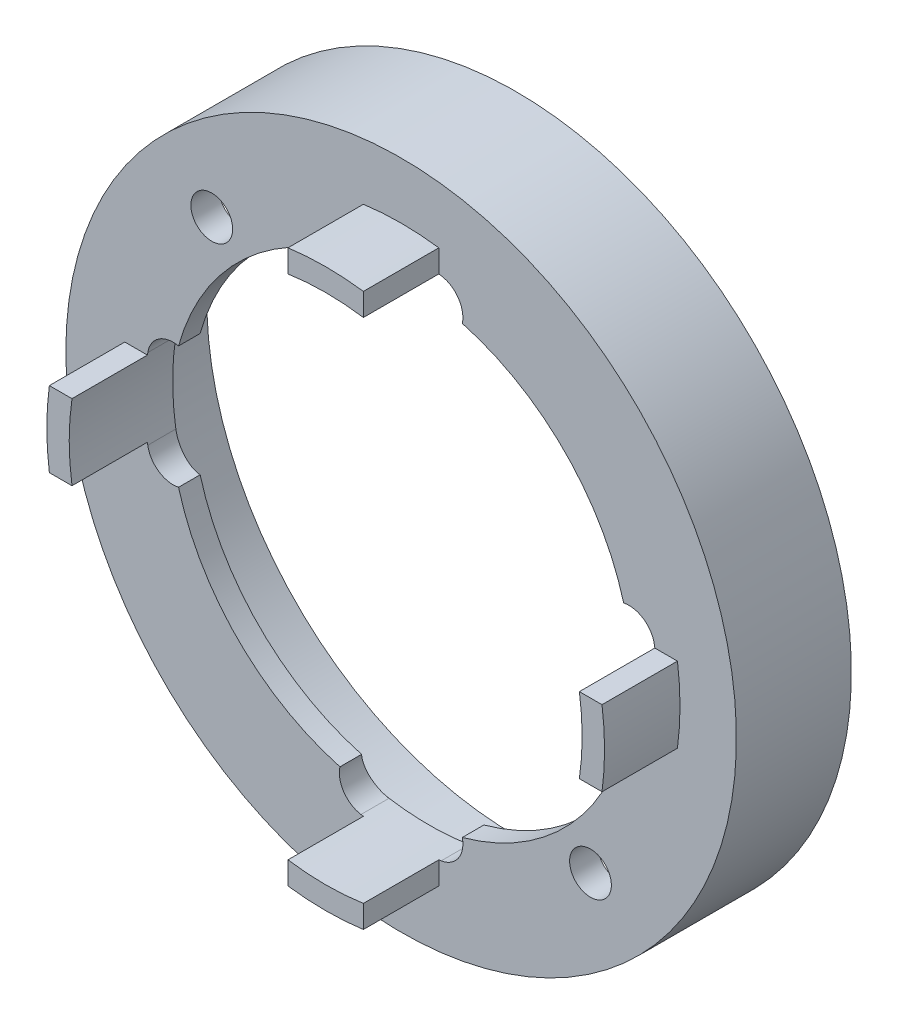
ISO-10303-21;
HEADER;
FILE_DESCRIPTION(('STEP AP214'),'2;1');
FILE_NAME('part.step','',(''),(''),'','','');
FILE_SCHEMA(('AUTOMOTIVE_DESIGN { 1 0 10303 214 1 1 1 1 }'));
ENDSEC;
DATA;
#1=APPLICATION_CONTEXT('core data for automotive mechanical design processes');
#2=APPLICATION_PROTOCOL_DEFINITION('international standard','automotive_design',2000,#1);
#3=PRODUCT_CONTEXT('',#1,'mechanical');
#4=PRODUCT('Part','Part','',(#3));
#5=PRODUCT_RELATED_PRODUCT_CATEGORY('part','',(#4));
#6=PRODUCT_DEFINITION_FORMATION('','',#4);
#7=PRODUCT_DEFINITION_CONTEXT('part definition',#1,'design');
#8=PRODUCT_DEFINITION('design','',#6,#7);
#9=PRODUCT_DEFINITION_SHAPE('','',#8);
#10=(LENGTH_UNIT() NAMED_UNIT(*) SI_UNIT(.MILLI.,.METRE.));
#11=(NAMED_UNIT(*) PLANE_ANGLE_UNIT() SI_UNIT($,.RADIAN.));
#12=(NAMED_UNIT(*) SI_UNIT($,.STERADIAN.) SOLID_ANGLE_UNIT());
#13=UNCERTAINTY_MEASURE_WITH_UNIT(LENGTH_MEASURE(1.E-05),#10,'distance_accuracy_value','');
#14=(GEOMETRIC_REPRESENTATION_CONTEXT(3) GLOBAL_UNCERTAINTY_ASSIGNED_CONTEXT((#13)) GLOBAL_UNIT_ASSIGNED_CONTEXT((#10,
#11,#12)) REPRESENTATION_CONTEXT('',''));
#15=CARTESIAN_POINT('',(0.,0.,0.));
#16=DIRECTION('',(0.,0.,1.));
#17=DIRECTION('',(1.,0.,0.));
#18=AXIS2_PLACEMENT_3D('',#15,#16,#17);
#19=CARTESIAN_POINT('',(0.,0.,-0.00100000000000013));
#20=DIRECTION('',(0.,0.,1.));
#21=DIRECTION('',(1.,0.,0.));
#22=AXIS2_PLACEMENT_3D('',#19,#20,#21);
#23=CYLINDRICAL_SURFACE('',#22,15.3);
#24=CARTESIAN_POINT('',(0.,0.,7.62));
#25=DIRECTION('',(0.,0.,1.));
#26=DIRECTION('',(1.,0.,0.));
#27=AXIS2_PLACEMENT_3D('',#24,#25,#26);
#28=CIRCLE('',#27,15.3);
#29=CARTESIAN_POINT('',(14.7528220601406,4.05514996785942,7.62));
#30=VERTEX_POINT('',#29);
#31=CARTESIAN_POINT('',(4.05514996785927,14.7528220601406,7.62));
#32=VERTEX_POINT('',#31);
#33=EDGE_CURVE('E306',#30,#32,#28,.T.);
#34=ORIENTED_EDGE('',*,*,#33,.T.);
#35=DIRECTION('',(0.,0.,1.));
#36=VECTOR('',#35,1.);
#37=CARTESIAN_POINT('',(4.05514996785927,14.7528220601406,6.90383405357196));
#38=LINE('',#37,#36);
#39=CARTESIAN_POINT('',(4.05514996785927,14.7528220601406,6.18766810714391));
#40=VERTEX_POINT('',#39);
#41=EDGE_CURVE('E439',#40,#32,#38,.T.);
#42=ORIENTED_EDGE('',*,*,#41,.F.);
#43=CARTESIAN_POINT('',(0.,0.,6.18766810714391));
#44=DIRECTION('',(0.,0.,-1.));
#45=DIRECTION('',(-1.,0.,0.));
#46=AXIS2_PLACEMENT_3D('',#43,#44,#45);
#47=CIRCLE('',#46,15.3);
#48=CARTESIAN_POINT('',(14.7528220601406,4.05514996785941,6.18766810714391));
#49=VERTEX_POINT('',#48);
#50=EDGE_CURVE('E293',#49,#40,#47,.F.);
#51=ORIENTED_EDGE('',*,*,#50,.F.);
#52=DIRECTION('',(0.,0.,1.));
#53=VECTOR('',#52,1.);
#54=CARTESIAN_POINT('',(14.7528220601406,4.05514996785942,6.90383405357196));
#55=LINE('',#54,#53);
#56=EDGE_CURVE('E330',#30,#49,#55,.F.);
#57=ORIENTED_EDGE('',*,*,#56,.F.);
#58=EDGE_LOOP('',(#34,#42,#51,#57));
#59=FACE_BOUND('',#58,.T.);
#60=ADVANCED_FACE('F37',(#59),#23,.F.);
#61=CARTESIAN_POINT('',(0.,0.,5.76128841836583));
#62=DIRECTION('',(0.,0.,-1.));
#63=DIRECTION('',(-1.,0.,0.));
#64=AXIS2_PLACEMENT_3D('',#61,#62,#63);
#65=CONICAL_SURFACE('',#64,17.,1.32505396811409);
#66=CARTESIAN_POINT('',(4.05498122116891,14.7520414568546,6.18786810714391));
#67=CARTESIAN_POINT('',(4.06531204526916,14.7997816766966,6.17563544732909));
#68=CARTESIAN_POINT('',(4.07358291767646,14.8479515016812,6.16343635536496));
#69=CARTESIAN_POINT('',(4.0859531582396,14.9448588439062,6.13917474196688));
#70=CARTESIAN_POINT('',(4.09005242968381,14.9935963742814,6.12711222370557));
#71=CARTESIAN_POINT('',(4.09601168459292,15.1401417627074,6.0912536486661));
#72=CARTESIAN_POINT('',(4.09154977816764,15.2383596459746,6.06776680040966));
#73=CARTESIAN_POINT('',(4.06569609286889,15.4329354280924,6.02227086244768));
#74=CARTESIAN_POINT('',(4.04429026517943,15.5292917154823,6.00026301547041));
#75=CARTESIAN_POINT('',(3.98496845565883,15.7172383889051,5.95830988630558));
#76=CARTESIAN_POINT('',(3.94705928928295,15.8088307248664,5.93836375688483));
#77=CARTESIAN_POINT('',(3.85631208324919,15.9831485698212,5.9013275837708));
#78=CARTESIAN_POINT('',(3.80370261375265,16.0659849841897,5.8841997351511));
#79=CARTESIAN_POINT('',(3.68467918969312,16.2217314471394,5.85289111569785));
#80=CARTESIAN_POINT('',(3.61826476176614,16.2946411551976,5.83871044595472));
#81=CARTESIAN_POINT('',(3.47537955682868,16.4264035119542,5.81400318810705));
#82=CARTESIAN_POINT('',(3.39921409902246,16.4855715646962,5.80339140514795));
#83=CARTESIAN_POINT('',(3.23770553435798,16.5903058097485,5.78560536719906));
#84=CARTESIAN_POINT('',(3.15236794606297,16.6358801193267,5.77842905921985));
#85=CARTESIAN_POINT('',(2.99893918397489,16.7017124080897,5.76914379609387));
#86=CARTESIAN_POINT('',(2.9323798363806,16.7254825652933,5.76619117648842));
#87=CARTESIAN_POINT('',(2.79682728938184,16.7645905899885,5.76225661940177));
#88=CARTESIAN_POINT('',(2.7278359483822,16.779934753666,5.76127320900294));
#89=CARTESIAN_POINT('',(2.65812006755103,16.7909017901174,5.76128852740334));
#90=B_SPLINE_CURVE_WITH_KNOTS('',3,(#66,#67,#68,#69,#70,#71,#72,#73,#74,#75,#76,#77,#78,#79,#80,
#81,#82,#83,#84,#85,#86,#87,#88,#89),.UNSPECIFIED.,.F.,.F.,(4,2,2,2,2,2,2,2,2,2,2,4),(0.,
0.15096990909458,0.301943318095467,0.603648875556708,0.90560485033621,1.20743624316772,
1.50481333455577,1.80220062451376,2.09187879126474,2.38138363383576,2.59305210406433,
2.80456219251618),.UNSPECIFIED.);
#91=CARTESIAN_POINT('',(2.6593859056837,16.7907017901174,5.76128841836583));
#92=VERTEX_POINT('',#91);
#93=EDGE_CURVE('E361',#40,#92,#90,.T.);
#94=ORIENTED_EDGE('',*,*,#93,.T.);
#95=CARTESIAN_POINT('',(0.,0.,5.76128841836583));
#96=DIRECTION('',(0.,0.,1.));
#97=DIRECTION('',(1.,0.,0.));
#98=AXIS2_PLACEMENT_3D('',#95,#96,#97);
#99=CIRCLE('',#98,17.);
#100=CARTESIAN_POINT('',(16.7907017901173,2.65938590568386,5.76128841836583));
#101=VERTEX_POINT('',#100);
#102=EDGE_CURVE('E273',#101,#92,#99,.T.);
#103=ORIENTED_EDGE('',*,*,#102,.F.);
#104=CARTESIAN_POINT('',(16.7909017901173,2.6581200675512,5.76128852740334));
#105=CARTESIAN_POINT('',(16.78359167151,2.70450246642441,5.76128069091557));
#106=CARTESIAN_POINT('',(16.774361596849,2.75055928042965,5.76171194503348));
#107=CARTESIAN_POINT('',(16.7521325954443,2.84173286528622,5.76344884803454));
#108=CARTESIAN_POINT('',(16.7391340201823,2.88684972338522,5.76475441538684));
#109=CARTESIAN_POINT('',(16.6946581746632,3.02016427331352,5.769968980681));
#110=CARTESIAN_POINT('',(16.6576663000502,3.10654299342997,5.77517584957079));
#111=CARTESIAN_POINT('',(16.5701349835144,3.27181355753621,5.7889220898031));
#112=CARTESIAN_POINT('',(16.5195920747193,3.3507034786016,5.79746231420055));
#113=CARTESIAN_POINT('',(16.4064931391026,3.49889648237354,5.81766419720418));
#114=CARTESIAN_POINT('',(16.3439367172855,3.56819924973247,5.82932595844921));
#115=CARTESIAN_POINT('',(16.2079954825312,3.6960531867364,5.85561980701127));
#116=CARTESIAN_POINT('',(16.1345083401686,3.75448952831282,5.8702805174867));
#117=CARTESIAN_POINT('',(15.9793264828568,3.85831009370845,5.90214611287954));
#118=CARTESIAN_POINT('',(15.897630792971,3.90369276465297,5.91935130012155));
#119=CARTESIAN_POINT('',(15.7263513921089,3.98126433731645,5.95632849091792));
#120=CARTESIAN_POINT('',(15.6366281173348,4.0131207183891,5.97615101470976));
#121=CARTESIAN_POINT('',(15.4534988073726,4.06140943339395,6.01756262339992));
#122=CARTESIAN_POINT('',(15.3600920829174,4.07783886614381,6.03915203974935));
#123=CARTESIAN_POINT('',(15.1801001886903,4.09426185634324,6.08169630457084));
#124=CARTESIAN_POINT('',(15.0936039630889,4.09552451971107,6.10255115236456));
#125=CARTESIAN_POINT('',(14.9216162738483,4.08499915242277,6.14486183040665));
#126=CARTESIAN_POINT('',(14.8361242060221,4.07321942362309,6.16631726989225));
#127=CARTESIAN_POINT('',(14.7520414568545,4.05498122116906,6.18786810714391));
#128=B_SPLINE_CURVE_WITH_KNOTS('',3,(#104,#105,#106,#107,#108,#109,#110,#111,#112,#113,#114,
#115,#116,#117,#118,#119,#120,#121,#122,#123,#124,#125,#126,#127),.UNSPECIFIED.,.F.,.F.,(4,2,2,
2,2,2,2,2,2,2,2,4),(0.,0.140777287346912,0.281541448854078,0.562418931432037,0.843368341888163,
1.12432699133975,1.40810406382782,1.69191488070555,1.98234716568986,2.27283405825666,
2.53882616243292,2.80464905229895),.UNSPECIFIED.);
#129=EDGE_CURVE('E329',#101,#49,#128,.T.);
#130=ORIENTED_EDGE('',*,*,#129,.T.);
#131=ORIENTED_EDGE('',*,*,#50,.T.);
#132=EDGE_LOOP('',(#94,#103,#130,#131));
#133=FACE_BOUND('',#132,.T.);
#134=ADVANCED_FACE('F397',(#133),#65,.F.);
#135=CARTESIAN_POINT('',(4.05514996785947,-14.7528220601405,7.62));
#136=VERTEX_POINT('',#135);
#137=CARTESIAN_POINT('',(14.7528220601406,-4.05514996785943,7.62));
#138=VERTEX_POINT('',#137);
#139=EDGE_CURVE('E325',#136,#138,#28,.T.);
#140=ORIENTED_EDGE('',*,*,#139,.T.);
#141=DIRECTION('',(0.,0.,1.));
#142=VECTOR('',#141,1.);
#143=CARTESIAN_POINT('',(14.7528220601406,-4.05514996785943,6.90383405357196));
#144=LINE('',#143,#142);
#145=CARTESIAN_POINT('',(14.7528220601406,-4.05514996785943,6.18766810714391));
#146=VERTEX_POINT('',#145);
#147=EDGE_CURVE('E324',#146,#138,#144,.T.);
#148=ORIENTED_EDGE('',*,*,#147,.F.);
#149=CARTESIAN_POINT('',(4.05514996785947,-14.7528220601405,6.18766810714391));
#150=VERTEX_POINT('',#149);
#151=EDGE_CURVE('E298',#150,#146,#47,.F.);
#152=ORIENTED_EDGE('',*,*,#151,.F.);
#153=DIRECTION('',(0.,0.,1.));
#154=VECTOR('',#153,1.);
#155=CARTESIAN_POINT('',(4.05514996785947,-14.7528220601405,6.90383405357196));
#156=LINE('',#155,#154);
#157=EDGE_CURVE('E322',#136,#150,#156,.F.);
#158=ORIENTED_EDGE('',*,*,#157,.F.);
#159=EDGE_LOOP('',(#140,#148,#152,#158));
#160=FACE_BOUND('',#159,.T.);
#161=ADVANCED_FACE('F321',(#160),#23,.F.);
#162=CARTESIAN_POINT('',(11.1893019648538,-12.7994778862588,5.7610884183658));
#163=CARTESIAN_POINT('',(11.1823967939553,-12.7616062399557,5.76937945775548));
#164=CARTESIAN_POINT('',(11.1770660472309,-12.7234193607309,5.77746176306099));
#165=CARTESIAN_POINT('',(11.1696032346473,-12.6466331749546,5.79315097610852));
#166=CARTESIAN_POINT('',(11.1674715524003,-12.6080338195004,5.80075782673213));
#167=CARTESIAN_POINT('',(11.1659520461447,-12.4919770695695,5.82277173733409));
#168=CARTESIAN_POINT('',(11.1714363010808,-12.4142420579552,5.83637631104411));
#169=CARTESIAN_POINT('',(11.195494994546,-12.2603165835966,5.86092713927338));
#170=CARTESIAN_POINT('',(11.2140862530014,-12.1841282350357,5.87186995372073));
#171=CARTESIAN_POINT('',(11.2640149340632,-12.0356800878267,5.89064134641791));
#172=CARTESIAN_POINT('',(11.2953430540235,-11.9634174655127,5.8984721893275));
#173=CARTESIAN_POINT('',(11.3690607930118,-11.8266778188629,5.91054800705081));
#174=CARTESIAN_POINT('',(11.4111696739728,-11.7620565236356,5.91487382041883));
#175=CARTESIAN_POINT('',(11.5056248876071,-11.640601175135,5.92006361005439));
#176=CARTESIAN_POINT('',(11.5579728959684,-11.5837683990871,5.92092701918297));
#177=CARTESIAN_POINT('',(11.6701359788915,-11.4807316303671,5.91917174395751));
#178=CARTESIAN_POINT('',(11.7297679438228,-11.4343267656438,5.91662694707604));
#179=CARTESIAN_POINT('',(11.8556012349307,-11.3519123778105,5.9082913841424));
#180=CARTESIAN_POINT('',(11.9218010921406,-11.3159005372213,5.90250134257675));
#181=CARTESIAN_POINT('',(12.0590162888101,-11.2550973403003,5.8878930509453));
#182=CARTESIAN_POINT('',(12.1300417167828,-11.2303303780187,5.87906828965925));
#183=CARTESIAN_POINT('',(12.2748201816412,-11.1926434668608,5.85872427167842));
#184=CARTESIAN_POINT('',(12.3485739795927,-11.1797268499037,5.84720425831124));
#185=CARTESIAN_POINT('',(12.4857794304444,-11.1669374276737,5.82376298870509));
#186=CARTESIAN_POINT('',(12.5491381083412,-11.1654153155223,5.81215417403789));
#187=CARTESIAN_POINT('',(12.6751192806,-11.1709632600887,5.78757546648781));
#188=CARTESIAN_POINT('',(12.7377427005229,-11.1780209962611,5.77460754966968));
#189=CARTESIAN_POINT('',(12.799477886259,-11.1893019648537,5.7610884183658));
#190=B_SPLINE_CURVE_WITH_KNOTS('',3,(#162,#163,#164,#165,#166,#167,#168,#169,#170,#171,#172,
#173,#174,#175,#176,#177,#178,#179,#180,#181,#182,#183,#184,#185,#186,#187,#188,#189),
.UNSPECIFIED.,.F.,.F.,(4,2,2,2,2,2,2,2,2,2,2,2,2,4),(0.,0.118068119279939,0.23615039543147,
0.472256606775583,0.708666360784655,0.944903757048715,1.17552380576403,1.40618162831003,
1.63191903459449,1.85760606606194,2.08378037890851,2.31001826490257,2.50273003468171,
2.6951653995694),.UNSPECIFIED.);
#191=CARTESIAN_POINT('',(11.189135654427,-12.7985641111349,5.76128841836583));
#192=VERTEX_POINT('',#191);
#193=CARTESIAN_POINT('',(12.798564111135,-11.1891356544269,5.76128841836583));
#194=VERTEX_POINT('',#193);
#195=EDGE_CURVE('E57',#192,#194,#190,.T.);
#196=ORIENTED_EDGE('',*,*,#195,.F.);
#197=CARTESIAN_POINT('',(2.65938590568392,-16.7907017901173,5.76128841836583));
#198=VERTEX_POINT('',#197);
#199=EDGE_CURVE('E276',#198,#192,#99,.T.);
#200=ORIENTED_EDGE('',*,*,#199,.F.);
#201=CARTESIAN_POINT('',(2.65812006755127,-16.7909017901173,5.76128852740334));
#202=CARTESIAN_POINT('',(2.70450246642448,-16.78359167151,5.76128069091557));
#203=CARTESIAN_POINT('',(2.75055928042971,-16.774361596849,5.76171194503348));
#204=CARTESIAN_POINT('',(2.84173286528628,-16.7521325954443,5.76344884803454));
#205=CARTESIAN_POINT('',(2.88684972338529,-16.7391340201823,5.76475441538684));
#206=CARTESIAN_POINT('',(3.02016427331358,-16.6946581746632,5.769968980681));
#207=CARTESIAN_POINT('',(3.10654299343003,-16.6576663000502,5.77517584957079));
#208=CARTESIAN_POINT('',(3.27181355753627,-16.5701349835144,5.7889220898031));
#209=CARTESIAN_POINT('',(3.35070347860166,-16.5195920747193,5.79746231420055));
#210=CARTESIAN_POINT('',(3.49889648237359,-16.4064931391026,5.81766419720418));
#211=CARTESIAN_POINT('',(3.56819924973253,-16.3439367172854,5.82932595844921));
#212=CARTESIAN_POINT('',(3.69605318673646,-16.2079954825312,5.85561980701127));
#213=CARTESIAN_POINT('',(3.75448952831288,-16.1345083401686,5.8702805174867));
#214=CARTESIAN_POINT('',(3.8583100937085,-15.9793264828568,5.90214611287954));
#215=CARTESIAN_POINT('',(3.90369276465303,-15.8976307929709,5.91935130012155));
#216=CARTESIAN_POINT('',(3.9812643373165,-15.7263513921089,5.95632849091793));
#217=CARTESIAN_POINT('',(4.01312071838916,-15.6366281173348,5.97615101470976));
#218=CARTESIAN_POINT('',(4.061409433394,-15.4534988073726,6.01756262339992));
#219=CARTESIAN_POINT('',(4.07783886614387,-15.3600920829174,6.03915203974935));
#220=CARTESIAN_POINT('',(4.0942618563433,-15.1801001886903,6.08169630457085));
#221=CARTESIAN_POINT('',(4.09552451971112,-15.0936039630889,6.10255115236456));
#222=CARTESIAN_POINT('',(4.08499915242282,-14.9216162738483,6.14486183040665));
#223=CARTESIAN_POINT('',(4.07321942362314,-14.8361242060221,6.16631726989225));
#224=CARTESIAN_POINT('',(4.05498122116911,-14.7520414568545,6.18786810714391));
#225=B_SPLINE_CURVE_WITH_KNOTS('',3,(#201,#202,#203,#204,#205,#206,#207,#208,#209,#210,#211,
#212,#213,#214,#215,#216,#217,#218,#219,#220,#221,#222,#223,#224),.UNSPECIFIED.,.F.,.F.,(4,2,2,
2,2,2,2,2,2,2,2,4),(0.,0.140777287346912,0.281541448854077,0.562418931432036,0.843368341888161,
1.12432699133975,1.40810406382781,1.69191488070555,1.98234716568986,2.27283405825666,
2.53882616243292,2.80464905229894),.UNSPECIFIED.);
#226=EDGE_CURVE('E316',#198,#150,#225,.T.);
#227=ORIENTED_EDGE('',*,*,#226,.T.);
#228=ORIENTED_EDGE('',*,*,#151,.T.);
#229=CARTESIAN_POINT('',(14.7520414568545,-4.05498122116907,6.18786810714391));
#230=CARTESIAN_POINT('',(14.7997816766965,-4.06531204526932,6.17563544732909));
#231=CARTESIAN_POINT('',(14.8479515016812,-4.07358291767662,6.16343635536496));
#232=CARTESIAN_POINT('',(14.9448588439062,-4.08595315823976,6.13917474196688));
#233=CARTESIAN_POINT('',(14.9935963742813,-4.09005242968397,6.12711222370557));
#234=CARTESIAN_POINT('',(15.1401417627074,-4.09601168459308,6.0912536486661));
#235=CARTESIAN_POINT('',(15.2383596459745,-4.0915497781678,6.06776680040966));
#236=CARTESIAN_POINT('',(15.4329354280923,-4.06569609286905,6.02227086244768));
#237=CARTESIAN_POINT('',(15.5292917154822,-4.04429026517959,6.00026301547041));
#238=CARTESIAN_POINT('',(15.7172383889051,-3.984968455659,5.95830988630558));
#239=CARTESIAN_POINT('',(15.8088307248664,-3.94705928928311,5.93836375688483));
#240=CARTESIAN_POINT('',(15.9831485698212,-3.85631208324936,5.9013275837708));
#241=CARTESIAN_POINT('',(16.0659849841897,-3.80370261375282,5.8841997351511));
#242=CARTESIAN_POINT('',(16.2217314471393,-3.68467918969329,5.85289111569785));
#243=CARTESIAN_POINT('',(16.2946411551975,-3.61826476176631,5.83871044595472));
#244=CARTESIAN_POINT('',(16.4264035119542,-3.47537955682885,5.81400318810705));
#245=CARTESIAN_POINT('',(16.4855715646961,-3.39921409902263,5.80339140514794));
#246=CARTESIAN_POINT('',(16.5903058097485,-3.23770553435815,5.78560536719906));
#247=CARTESIAN_POINT('',(16.6358801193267,-3.15236794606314,5.77842905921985));
#248=CARTESIAN_POINT('',(16.7017124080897,-2.99893918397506,5.76914379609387));
#249=CARTESIAN_POINT('',(16.7254825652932,-2.93237983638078,5.76619117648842));
#250=CARTESIAN_POINT('',(16.7645905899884,-2.79682728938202,5.76225661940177));
#251=CARTESIAN_POINT('',(16.779934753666,-2.72783594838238,5.76127320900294));
#252=CARTESIAN_POINT('',(16.7909017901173,-2.65812006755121,5.76128852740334));
#253=B_SPLINE_CURVE_WITH_KNOTS('',3,(#229,#230,#231,#232,#233,#234,#235,#236,#237,#238,#239,
#240,#241,#242,#243,#244,#245,#246,#247,#248,#249,#250,#251,#252),.UNSPECIFIED.,.F.,.F.,(4,2,2,
2,2,2,2,2,2,2,2,4),(0.,0.150969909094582,0.30194331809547,0.60364887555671,0.905604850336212,
1.20743624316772,1.50481333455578,1.80220062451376,2.09187879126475,2.38138363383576,
2.59305210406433,2.80456219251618),.UNSPECIFIED.);
#254=CARTESIAN_POINT('',(16.7907017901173,-2.65938590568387,5.76128841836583));
#255=VERTEX_POINT('',#254);
#256=EDGE_CURVE('E314',#146,#255,#253,.T.);
#257=ORIENTED_EDGE('',*,*,#256,.T.);
#258=EDGE_CURVE('E275',#194,#255,#99,.T.);
#259=ORIENTED_EDGE('',*,*,#258,.F.);
#260=EDGE_LOOP('',(#196,#200,#227,#228,#257,#259));
#261=FACE_BOUND('',#260,.T.);
#262=ADVANCED_FACE('F313',(#261),#65,.F.);
#263=CARTESIAN_POINT('',(-14.7528220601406,-4.05514996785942,7.62));
#264=VERTEX_POINT('',#263);
#265=CARTESIAN_POINT('',(-4.05514996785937,-14.7528220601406,7.62));
#266=VERTEX_POINT('',#265);
#267=EDGE_CURVE('E307',#264,#266,#28,.T.);
#268=ORIENTED_EDGE('',*,*,#267,.T.);
#269=DIRECTION('',(0.,0.,1.));
#270=VECTOR('',#269,1.);
#271=CARTESIAN_POINT('',(-4.05514996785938,-14.7528220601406,6.90383405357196));
#272=LINE('',#271,#270);
#273=CARTESIAN_POINT('',(-4.05514996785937,-14.7528220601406,6.18766810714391));
#274=VERTEX_POINT('',#273);
#275=EDGE_CURVE('E458',#274,#266,#272,.T.);
#276=ORIENTED_EDGE('',*,*,#275,.F.);
#277=CARTESIAN_POINT('',(-14.7528220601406,-4.05514996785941,6.18766810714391));
#278=VERTEX_POINT('',#277);
#279=EDGE_CURVE('E294',#278,#274,#47,.F.);
#280=ORIENTED_EDGE('',*,*,#279,.F.);
#281=DIRECTION('',(0.,0.,1.));
#282=VECTOR('',#281,1.);
#283=CARTESIAN_POINT('',(-14.7528220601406,-4.05514996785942,6.90383405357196));
#284=LINE('',#283,#282);
#285=EDGE_CURVE('E1063',#264,#278,#284,.F.);
#286=ORIENTED_EDGE('',*,*,#285,.F.);
#287=EDGE_LOOP('',(#268,#276,#280,#286));
#288=FACE_BOUND('',#287,.T.);
#289=ADVANCED_FACE('F491',(#288),#23,.F.);
#290=CARTESIAN_POINT('',(-4.05498122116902,-14.7520414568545,6.18786810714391));
#291=CARTESIAN_POINT('',(-4.06531204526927,-14.7997816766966,6.17563544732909));
#292=CARTESIAN_POINT('',(-4.07358291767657,-14.8479515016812,6.16343635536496));
#293=CARTESIAN_POINT('',(-4.0859531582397,-14.9448588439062,6.13917474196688));
#294=CARTESIAN_POINT('',(-4.09005242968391,-14.9935963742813,6.12711222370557));
#295=CARTESIAN_POINT('',(-4.09601168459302,-15.1401417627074,6.0912536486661));
#296=CARTESIAN_POINT('',(-4.09154977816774,-15.2383596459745,6.06776680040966));
#297=CARTESIAN_POINT('',(-4.06569609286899,-15.4329354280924,6.02227086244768));
#298=CARTESIAN_POINT('',(-4.04429026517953,-15.5292917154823,6.00026301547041));
#299=CARTESIAN_POINT('',(-3.98496845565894,-15.7172383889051,5.95830988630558));
#300=CARTESIAN_POINT('',(-3.94705928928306,-15.8088307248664,5.93836375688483));
#301=CARTESIAN_POINT('',(-3.8563120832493,-15.9831485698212,5.9013275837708));
#302=CARTESIAN_POINT('',(-3.80370261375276,-16.0659849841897,5.8841997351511));
#303=CARTESIAN_POINT('',(-3.68467918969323,-16.2217314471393,5.85289111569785));
#304=CARTESIAN_POINT('',(-3.61826476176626,-16.2946411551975,5.83871044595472));
#305=CARTESIAN_POINT('',(-3.47537955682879,-16.4264035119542,5.81400318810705));
#306=CARTESIAN_POINT('',(-3.39921409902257,-16.4855715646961,5.80339140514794));
#307=CARTESIAN_POINT('',(-3.23770553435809,-16.5903058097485,5.78560536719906));
#308=CARTESIAN_POINT('',(-3.15236794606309,-16.6358801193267,5.77842905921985));
#309=CARTESIAN_POINT('',(-2.998939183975,-16.7017124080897,5.76914379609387));
#310=CARTESIAN_POINT('',(-2.93237983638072,-16.7254825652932,5.76619117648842));
#311=CARTESIAN_POINT('',(-2.79682728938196,-16.7645905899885,5.76225661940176));
#312=CARTESIAN_POINT('',(-2.72783594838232,-16.779934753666,5.76127320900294));
#313=CARTESIAN_POINT('',(-2.65812006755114,-16.7909017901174,5.76128852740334));
#314=B_SPLINE_CURVE_WITH_KNOTS('',3,(#290,#291,#292,#293,#294,#295,#296,#297,#298,#299,#300,
#301,#302,#303,#304,#305,#306,#307,#308,#309,#310,#311,#312,#313),.UNSPECIFIED.,.F.,.F.,(4,2,2,
2,2,2,2,2,2,2,2,4),(0.,0.15096990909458,0.301943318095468,0.60364887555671,0.905604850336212,
1.20743624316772,1.50481333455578,1.80220062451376,2.09187879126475,2.38138363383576,
2.59305210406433,2.80456219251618),.UNSPECIFIED.);
#315=CARTESIAN_POINT('',(-2.65938590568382,-16.7907017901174,5.76128841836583));
#316=VERTEX_POINT('',#315);
#317=EDGE_CURVE('E466',#274,#316,#314,.T.);
#318=ORIENTED_EDGE('',*,*,#317,.T.);
#319=CARTESIAN_POINT('',(-16.7907017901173,-2.65938590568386,5.76128841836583));
#320=VERTEX_POINT('',#319);
#321=EDGE_CURVE('E285',#320,#316,#99,.T.);
#322=ORIENTED_EDGE('',*,*,#321,.F.);
#323=CARTESIAN_POINT('',(-16.7909017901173,-2.6581200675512,5.76128852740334));
#324=CARTESIAN_POINT('',(-16.78359167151,-2.70450246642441,5.76128069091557));
#325=CARTESIAN_POINT('',(-16.774361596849,-2.75055928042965,5.76171194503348));
#326=CARTESIAN_POINT('',(-16.7521325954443,-2.84173286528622,5.76344884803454));
#327=CARTESIAN_POINT('',(-16.7391340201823,-2.88684972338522,5.76475441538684));
#328=CARTESIAN_POINT('',(-16.6946581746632,-3.02016427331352,5.769968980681));
#329=CARTESIAN_POINT('',(-16.6576663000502,-3.10654299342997,5.77517584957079));
#330=CARTESIAN_POINT('',(-16.5701349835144,-3.27181355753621,5.7889220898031));
#331=CARTESIAN_POINT('',(-16.5195920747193,-3.3507034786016,5.79746231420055));
#332=CARTESIAN_POINT('',(-16.4064931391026,-3.49889648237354,5.81766419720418));
#333=CARTESIAN_POINT('',(-16.3439367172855,-3.56819924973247,5.82932595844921));
#334=CARTESIAN_POINT('',(-16.2079954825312,-3.6960531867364,5.85561980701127));
#335=CARTESIAN_POINT('',(-16.1345083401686,-3.75448952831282,5.8702805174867));
#336=CARTESIAN_POINT('',(-15.9793264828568,-3.85831009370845,5.90214611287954));
#337=CARTESIAN_POINT('',(-15.897630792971,-3.90369276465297,5.91935130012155));
#338=CARTESIAN_POINT('',(-15.7263513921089,-3.98126433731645,5.95632849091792));
#339=CARTESIAN_POINT('',(-15.6366281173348,-4.0131207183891,5.97615101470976));
#340=CARTESIAN_POINT('',(-15.4534988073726,-4.06140943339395,6.01756262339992));
#341=CARTESIAN_POINT('',(-15.3600920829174,-4.07783886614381,6.03915203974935));
#342=CARTESIAN_POINT('',(-15.1801001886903,-4.09426185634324,6.08169630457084));
#343=CARTESIAN_POINT('',(-15.0936039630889,-4.09552451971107,6.10255115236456));
#344=CARTESIAN_POINT('',(-14.9216162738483,-4.08499915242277,6.14486183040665));
#345=CARTESIAN_POINT('',(-14.8361242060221,-4.07321942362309,6.16631726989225));
#346=CARTESIAN_POINT('',(-14.7520414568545,-4.05498122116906,6.18786810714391));
#347=B_SPLINE_CURVE_WITH_KNOTS('',3,(#323,#324,#325,#326,#327,#328,#329,#330,#331,#332,#333,
#334,#335,#336,#337,#338,#339,#340,#341,#342,#343,#344,#345,#346),.UNSPECIFIED.,.F.,.F.,(4,2,2,
2,2,2,2,2,2,2,2,4),(0.,0.140777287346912,0.281541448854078,0.562418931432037,0.843368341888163,
1.12432699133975,1.40810406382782,1.69191488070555,1.98234716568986,2.27283405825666,
2.53882616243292,2.80464905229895),.UNSPECIFIED.);
#348=EDGE_CURVE('E889',#320,#278,#347,.T.);
#349=ORIENTED_EDGE('',*,*,#348,.T.);
#350=ORIENTED_EDGE('',*,*,#279,.T.);
#351=EDGE_LOOP('',(#318,#322,#349,#350));
#352=FACE_BOUND('',#351,.T.);
#353=ADVANCED_FACE('F398',(#352),#65,.F.);
#354=CARTESIAN_POINT('',(0.,0.,7.62));
#355=DIRECTION('',(0.,0.,1.));
#356=DIRECTION('',(1.,0.,0.));
#357=AXIS2_PLACEMENT_3D('',#354,#355,#356);
#358=PLANE('',#357);
#359=CARTESIAN_POINT('',(-12.5511453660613,12.5511453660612,7.62));
#360=DIRECTION('',(0.,0.,1.));
#361=DIRECTION('',(1.,0.,0.));
#362=AXIS2_PLACEMENT_3D('',#359,#360,#361);
#363=CIRCLE('',#362,1.3843);
#364=CARTESIAN_POINT('',(-11.1668453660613,12.5511453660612,7.62));
#365=VERTEX_POINT('',#364);
#366=EDGE_CURVE('E266',#365,#365,#363,.T.);
#367=ORIENTED_EDGE('',*,*,#366,.F.);
#368=EDGE_LOOP('',(#367));
#369=FACE_BOUND('',#368,.T.);
#370=CARTESIAN_POINT('',(12.5511453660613,-12.5511453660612,7.62));
#371=DIRECTION('',(0.,0.,1.));
#372=DIRECTION('',(1.,0.,0.));
#373=AXIS2_PLACEMENT_3D('',#370,#371,#372);
#374=CIRCLE('',#373,1.3843);
#375=CARTESIAN_POINT('',(13.9354453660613,-12.5511453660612,7.62));
#376=VERTEX_POINT('',#375);
#377=EDGE_CURVE('E391',#376,#376,#374,.T.);
#378=ORIENTED_EDGE('',*,*,#377,.F.);
#379=EDGE_LOOP('',(#378));
#380=FACE_BOUND('',#379,.T.);
#381=CARTESIAN_POINT('',(2.39344731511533,15.1116316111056,7.62));
#382=DIRECTION('',(0.,0.,1.));
#383=DIRECTION('',(0.,-1.,0.));
#384=AXIS2_PLACEMENT_3D('',#381,#382,#383);
#385=CIRCLE('',#384,1.69999999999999);
#386=CARTESIAN_POINT('',(2.6593859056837,16.7907017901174,7.62));
#387=VERTEX_POINT('',#386);
#388=EDGE_CURVE('E368',#32,#387,#385,.T.);
#389=ORIENTED_EDGE('',*,*,#388,.F.);
#390=ORIENTED_EDGE('',*,*,#33,.F.);
#391=CARTESIAN_POINT('',(15.1116316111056,2.39344731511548,7.62));
#392=DIRECTION('',(0.,0.,1.));
#393=DIRECTION('',(-1.,0.,0.));
#394=AXIS2_PLACEMENT_3D('',#391,#392,#393);
#395=CIRCLE('',#394,1.69999999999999);
#396=CARTESIAN_POINT('',(16.7907017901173,2.65938590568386,7.62));
#397=VERTEX_POINT('',#396);
#398=EDGE_CURVE('E441',#397,#30,#395,.T.);
#399=ORIENTED_EDGE('',*,*,#398,.F.);
#400=CARTESIAN_POINT('',(0.,0.,7.62));
#401=DIRECTION('',(0.,0.,1.));
#402=DIRECTION('',(-1.,0.,0.));
#403=AXIS2_PLACEMENT_3D('',#400,#401,#402);
#404=CIRCLE('',#403,17.);
#405=CARTESIAN_POINT('',(16.8151717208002,2.5,7.62));
#406=VERTEX_POINT('',#405);
#407=EDGE_CURVE('E444',#406,#397,#404,.T.);
#408=ORIENTED_EDGE('',*,*,#407,.F.);
#409=DIRECTION('',(-1.,0.,0.));
#410=VECTOR('',#409,1.);
#411=CARTESIAN_POINT('',(18.3151717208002,2.5,7.62));
#412=LINE('',#411,#410);
#413=CARTESIAN_POINT('',(18.3151717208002,2.5,7.62));
#414=VERTEX_POINT('',#413);
#415=EDGE_CURVE('E1014',#414,#406,#412,.T.);
#416=ORIENTED_EDGE('',*,*,#415,.F.);
#417=CARTESIAN_POINT('',(0.,0.,7.62));
#418=DIRECTION('',(0.,0.,1.));
#419=DIRECTION('',(-1.,0.,0.));
#420=AXIS2_PLACEMENT_3D('',#417,#418,#419);
#421=CIRCLE('',#420,18.4850078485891);
#422=CARTESIAN_POINT('',(18.3151717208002,-2.5,7.62));
#423=VERTEX_POINT('',#422);
#424=EDGE_CURVE('E1022',#423,#414,#421,.T.);
#425=ORIENTED_EDGE('',*,*,#424,.F.);
#426=DIRECTION('',(1.,0.,0.));
#427=VECTOR('',#426,1.);
#428=CARTESIAN_POINT('',(16.8151717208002,-2.5,7.62));
#429=LINE('',#428,#427);
#430=CARTESIAN_POINT('',(16.8151717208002,-2.5,7.62));
#431=VERTEX_POINT('',#430);
#432=EDGE_CURVE('E1009',#431,#423,#429,.T.);
#433=ORIENTED_EDGE('',*,*,#432,.F.);
#434=CARTESIAN_POINT('',(16.7907017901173,-2.65938590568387,7.62));
#435=VERTEX_POINT('',#434);
#436=EDGE_CURVE('E448',#435,#431,#404,.T.);
#437=ORIENTED_EDGE('',*,*,#436,.F.);
#438=CARTESIAN_POINT('',(15.1116316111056,-2.39344731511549,7.62));
#439=DIRECTION('',(0.,0.,1.));
#440=DIRECTION('',(-1.,0.,0.));
#441=AXIS2_PLACEMENT_3D('',#438,#439,#440);
#442=CIRCLE('',#441,1.69999999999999);
#443=EDGE_CURVE('E1071',#138,#435,#442,.T.);
#444=ORIENTED_EDGE('',*,*,#443,.F.);
#445=ORIENTED_EDGE('',*,*,#139,.F.);
#446=CARTESIAN_POINT('',(2.39344731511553,-15.1116316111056,7.62));
#447=DIRECTION('',(0.,0.,1.));
#448=DIRECTION('',(0.,1.,0.));
#449=AXIS2_PLACEMENT_3D('',#446,#447,#448);
#450=CIRCLE('',#449,1.69999999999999);
#451=CARTESIAN_POINT('',(2.65938590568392,-16.7907017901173,7.62));
#452=VERTEX_POINT('',#451);
#453=EDGE_CURVE('E973',#452,#136,#450,.T.);
#454=ORIENTED_EDGE('',*,*,#453,.F.);
#455=CARTESIAN_POINT('',(0.,0.,7.62));
#456=DIRECTION('',(0.,0.,1.));
#457=DIRECTION('',(0.,1.,0.));
#458=AXIS2_PLACEMENT_3D('',#455,#456,#457);
#459=CIRCLE('',#458,17.);
#460=CARTESIAN_POINT('',(2.50000000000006,-16.8151717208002,7.62));
#461=VERTEX_POINT('',#460);
#462=EDGE_CURVE('E969',#461,#452,#459,.T.);
#463=ORIENTED_EDGE('',*,*,#462,.F.);
#464=DIRECTION('',(0.,1.,0.));
#465=VECTOR('',#464,1.);
#466=CARTESIAN_POINT('',(2.50000000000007,-18.3151717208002,7.62));
#467=LINE('',#466,#465);
#468=CARTESIAN_POINT('',(2.50000000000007,-18.3151717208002,7.62));
#469=VERTEX_POINT('',#468);
#470=EDGE_CURVE('E1041',#469,#461,#467,.T.);
#471=ORIENTED_EDGE('',*,*,#470,.F.);
#472=CARTESIAN_POINT('',(0.,0.,7.62));
#473=DIRECTION('',(0.,0.,1.));
#474=DIRECTION('',(0.,1.,0.));
#475=AXIS2_PLACEMENT_3D('',#472,#473,#474);
#476=CIRCLE('',#475,18.4850078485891);
#477=CARTESIAN_POINT('',(-2.49999999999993,-18.3151717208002,7.62));
#478=VERTEX_POINT('',#477);
#479=EDGE_CURVE('E1049',#478,#469,#476,.T.);
#480=ORIENTED_EDGE('',*,*,#479,.F.);
#481=DIRECTION('',(0.,-1.,0.));
#482=VECTOR('',#481,1.);
#483=CARTESIAN_POINT('',(-2.49999999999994,-16.8151717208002,7.62));
#484=LINE('',#483,#482);
#485=CARTESIAN_POINT('',(-2.49999999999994,-16.8151717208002,7.62));
#486=VERTEX_POINT('',#485);
#487=EDGE_CURVE('E1036',#486,#478,#484,.T.);
#488=ORIENTED_EDGE('',*,*,#487,.F.);
#489=CARTESIAN_POINT('',(-2.65938590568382,-16.7907017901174,7.62));
#490=VERTEX_POINT('',#489);
#491=EDGE_CURVE('E968',#490,#486,#459,.T.);
#492=ORIENTED_EDGE('',*,*,#491,.F.);
#493=CARTESIAN_POINT('',(-2.39344731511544,-15.1116316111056,7.62));
#494=DIRECTION('',(0.,0.,1.));
#495=DIRECTION('',(0.,1.,0.));
#496=AXIS2_PLACEMENT_3D('',#493,#494,#495);
#497=CIRCLE('',#496,1.69999999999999);
#498=EDGE_CURVE('E966',#266,#490,#497,.T.);
#499=ORIENTED_EDGE('',*,*,#498,.F.);
#500=ORIENTED_EDGE('',*,*,#267,.F.);
#501=CARTESIAN_POINT('',(-15.1116316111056,-2.39344731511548,7.62));
#502=DIRECTION('',(0.,0.,1.));
#503=DIRECTION('',(1.,0.,0.));
#504=AXIS2_PLACEMENT_3D('',#501,#502,#503);
#505=CIRCLE('',#504,1.69999999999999);
#506=CARTESIAN_POINT('',(-16.7907017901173,-2.65938590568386,7.62));
#507=VERTEX_POINT('',#506);
#508=EDGE_CURVE('E907',#507,#264,#505,.T.);
#509=ORIENTED_EDGE('',*,*,#508,.F.);
#510=CARTESIAN_POINT('',(0.,0.,7.62));
#511=DIRECTION('',(0.,0.,1.));
#512=DIRECTION('',(1.,0.,0.));
#513=AXIS2_PLACEMENT_3D('',#510,#511,#512);
#514=CIRCLE('',#513,17.);
#515=CARTESIAN_POINT('',(-16.8151717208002,-2.5,7.62));
#516=VERTEX_POINT('',#515);
#517=EDGE_CURVE('E904',#516,#507,#514,.T.);
#518=ORIENTED_EDGE('',*,*,#517,.F.);
#519=DIRECTION('',(1.,0.,0.));
#520=VECTOR('',#519,1.);
#521=CARTESIAN_POINT('',(-18.3151717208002,-2.5,7.62));
#522=LINE('',#521,#520);
#523=CARTESIAN_POINT('',(-18.3151717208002,-2.5,7.62));
#524=VERTEX_POINT('',#523);
#525=EDGE_CURVE('E919',#524,#516,#522,.T.);
#526=ORIENTED_EDGE('',*,*,#525,.F.);
#527=CARTESIAN_POINT('',(0.,0.,7.62));
#528=DIRECTION('',(0.,0.,1.));
#529=DIRECTION('',(1.,0.,0.));
#530=AXIS2_PLACEMENT_3D('',#527,#528,#529);
#531=CIRCLE('',#530,18.4850078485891);
#532=CARTESIAN_POINT('',(-18.3151717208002,2.5,7.62));
#533=VERTEX_POINT('',#532);
#534=EDGE_CURVE('E927',#533,#524,#531,.T.);
#535=ORIENTED_EDGE('',*,*,#534,.F.);
#536=DIRECTION('',(-1.,0.,0.));
#537=VECTOR('',#536,1.);
#538=CARTESIAN_POINT('',(-16.8151717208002,2.5,7.62));
#539=LINE('',#538,#537);
#540=CARTESIAN_POINT('',(-16.8151717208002,2.5,7.62));
#541=VERTEX_POINT('',#540);
#542=EDGE_CURVE('E913',#541,#533,#539,.T.);
#543=ORIENTED_EDGE('',*,*,#542,.F.);
#544=CARTESIAN_POINT('',(-16.7907017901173,2.65938590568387,7.62));
#545=VERTEX_POINT('',#544);
#546=EDGE_CURVE('E905',#545,#541,#514,.T.);
#547=ORIENTED_EDGE('',*,*,#546,.F.);
#548=CARTESIAN_POINT('',(-15.1116316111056,2.39344731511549,7.62));
#549=DIRECTION('',(0.,0.,1.));
#550=DIRECTION('',(1.,0.,0.));
#551=AXIS2_PLACEMENT_3D('',#548,#549,#550);
#552=CIRCLE('',#551,1.69999999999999);
#553=CARTESIAN_POINT('',(-14.7528220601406,4.05514996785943,7.62));
#554=VERTEX_POINT('',#553);
#555=EDGE_CURVE('E900',#554,#545,#552,.T.);
#556=ORIENTED_EDGE('',*,*,#555,.F.);
#557=CARTESIAN_POINT('',(-4.05514996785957,14.7528220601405,7.62));
#558=VERTEX_POINT('',#557);
#559=EDGE_CURVE('E301',#558,#554,#28,.T.);
#560=ORIENTED_EDGE('',*,*,#559,.F.);
#561=CARTESIAN_POINT('',(-2.39344731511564,15.1116316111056,7.62));
#562=DIRECTION('',(0.,0.,1.));
#563=DIRECTION('',(0.,-1.,0.));
#564=AXIS2_PLACEMENT_3D('',#561,#562,#563);
#565=CIRCLE('',#564,1.69999999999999);
#566=CARTESIAN_POINT('',(-2.65938590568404,16.7907017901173,7.62));
#567=VERTEX_POINT('',#566);
#568=EDGE_CURVE('E1086',#567,#558,#565,.T.);
#569=ORIENTED_EDGE('',*,*,#568,.F.);
#570=CARTESIAN_POINT('',(0.,0.,7.62));
#571=DIRECTION('',(0.,0.,1.));
#572=DIRECTION('',(0.,-1.,0.));
#573=AXIS2_PLACEMENT_3D('',#570,#571,#572);
#574=CIRCLE('',#573,17.);
#575=CARTESIAN_POINT('',(-2.50000000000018,16.8151717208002,7.62));
#576=VERTEX_POINT('',#575);
#577=EDGE_CURVE('E1093',#576,#567,#574,.T.);
#578=ORIENTED_EDGE('',*,*,#577,.F.);
#579=DIRECTION('',(0.,-1.,0.));
#580=VECTOR('',#579,1.);
#581=CARTESIAN_POINT('',(-2.50000000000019,18.3151717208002,7.62));
#582=LINE('',#581,#580);
#583=CARTESIAN_POINT('',(-2.50000000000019,18.3151717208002,7.62));
#584=VERTEX_POINT('',#583);
#585=EDGE_CURVE('E986',#584,#576,#582,.T.);
#586=ORIENTED_EDGE('',*,*,#585,.F.);
#587=CARTESIAN_POINT('',(0.,0.,7.62));
#588=DIRECTION('',(0.,0.,1.));
#589=DIRECTION('',(0.,-1.,0.));
#590=AXIS2_PLACEMENT_3D('',#587,#588,#589);
#591=CIRCLE('',#590,18.4850078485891);
#592=CARTESIAN_POINT('',(2.49999999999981,18.3151717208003,7.62));
#593=VERTEX_POINT('',#592);
#594=EDGE_CURVE('E994',#593,#584,#591,.T.);
#595=ORIENTED_EDGE('',*,*,#594,.F.);
#596=DIRECTION('',(0.,1.,0.));
#597=VECTOR('',#596,1.);
#598=CARTESIAN_POINT('',(2.49999999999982,16.8151717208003,7.62));
#599=LINE('',#598,#597);
#600=CARTESIAN_POINT('',(2.49999999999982,16.8151717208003,7.62));
#601=VERTEX_POINT('',#600);
#602=EDGE_CURVE('E981',#601,#593,#599,.T.);
#603=ORIENTED_EDGE('',*,*,#602,.F.);
#604=EDGE_CURVE('E1092',#387,#601,#574,.T.);
#605=ORIENTED_EDGE('',*,*,#604,.F.);
#606=EDGE_LOOP('',(#389,#390,#399,#408,#416,#425,#433,#437,#444,#445,#454,#463,#471,#480,#488,
#492,#499,#500,#509,#518,#526,#535,#543,#547,#556,#560,#569,#578,#586,#595,#603,#605));
#607=FACE_BOUND('',#606,.T.);
#608=CARTESIAN_POINT('',(0.,0.,7.62));
#609=DIRECTION('',(0.,0.,1.));
#610=DIRECTION('',(1.,0.,0.));
#611=AXIS2_PLACEMENT_3D('',#608,#609,#610);
#612=CIRCLE('',#611,22.225);
#613=CARTESIAN_POINT('',(-22.225,0.,7.62));
#614=VERTEX_POINT('',#613);
#615=EDGE_CURVE('E45',#614,#614,#612,.T.);
#616=ORIENTED_EDGE('',*,*,#615,.T.);
#617=EDGE_LOOP('',(#616));
#618=FACE_BOUND('',#617,.T.);
#619=ADVANCED_FACE('F413',(#369,#380,#607,#618),#358,.T.);
#620=CARTESIAN_POINT('',(0.,0.,0.));
#621=DIRECTION('',(0.,0.,1.));
#622=DIRECTION('',(1.,0.,0.));
#623=AXIS2_PLACEMENT_3D('',#620,#621,#622);
#624=PLANE('',#623);
#625=CARTESIAN_POINT('',(0.,0.,0.));
#626=DIRECTION('',(0.,0.,1.));
#627=DIRECTION('',(1.,0.,0.));
#628=AXIS2_PLACEMENT_3D('',#625,#626,#627);
#629=CIRCLE('',#628,22.225);
#630=CARTESIAN_POINT('',(-22.225,0.,0.));
#631=VERTEX_POINT('',#630);
#632=EDGE_CURVE('E427',#631,#631,#629,.T.);
#633=ORIENTED_EDGE('',*,*,#632,.F.);
#634=EDGE_LOOP('',(#633));
#635=FACE_BOUND('',#634,.T.);
#636=CARTESIAN_POINT('',(0.,0.,0.));
#637=DIRECTION('',(0.,0.,1.));
#638=DIRECTION('',(1.,0.,0.));
#639=AXIS2_PLACEMENT_3D('',#636,#637,#638);
#640=CIRCLE('',#639,20.5);
#641=CARTESIAN_POINT('',(20.5,0.,0.));
#642=VERTEX_POINT('',#641);
#643=EDGE_CURVE('E942',#642,#642,#640,.T.);
#644=ORIENTED_EDGE('',*,*,#643,.T.);
#645=EDGE_LOOP('',(#644));
#646=FACE_BOUND('',#645,.T.);
#647=ADVANCED_FACE('F416',(#635,#646),#624,.F.);
#648=CARTESIAN_POINT('',(-4.05514996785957,14.7528220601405,6.18766810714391));
#649=VERTEX_POINT('',#648);
#650=CARTESIAN_POINT('',(-14.7528220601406,4.05514996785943,6.18766810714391));
#651=VERTEX_POINT('',#650);
#652=EDGE_CURVE('E291',#649,#651,#47,.F.);
#653=ORIENTED_EDGE('',*,*,#652,.F.);
#654=DIRECTION('',(0.,0.,1.));
#655=VECTOR('',#654,1.);
#656=CARTESIAN_POINT('',(-4.05514996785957,14.7528220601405,6.90383405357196));
#657=LINE('',#656,#655);
#658=EDGE_CURVE('E390',#558,#649,#657,.F.);
#659=ORIENTED_EDGE('',*,*,#658,.F.);
#660=ORIENTED_EDGE('',*,*,#559,.T.);
#661=DIRECTION('',(0.,0.,1.));
#662=VECTOR('',#661,1.);
#663=CARTESIAN_POINT('',(-14.7528220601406,4.05514996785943,6.90383405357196));
#664=LINE('',#663,#662);
#665=EDGE_CURVE('E1064',#651,#554,#664,.T.);
#666=ORIENTED_EDGE('',*,*,#665,.F.);
#667=EDGE_LOOP('',(#653,#659,#660,#666));
#668=FACE_BOUND('',#667,.T.);
#669=ADVANCED_FACE('F400',(#668),#23,.F.);
#670=CARTESIAN_POINT('',(0.,0.,7.62));
#671=DIRECTION('',(0.,0.,-1.));
#672=DIRECTION('',(-1.,0.,0.));
#673=AXIS2_PLACEMENT_3D('',#670,#671,#672);
#674=CYLINDRICAL_SURFACE('',#673,22.225);
#675=CARTESIAN_POINT('',(-22.225,0.,7.62));
#676=CARTESIAN_POINT('',(-22.225,0.,7.540625));
#677=CARTESIAN_POINT('',(-22.225,0.,7.46125));
#678=CARTESIAN_POINT('',(-22.225,0.,7.3025));
#679=CARTESIAN_POINT('',(-22.225,0.,7.223125));
#680=CARTESIAN_POINT('',(-22.225,0.,7.064375));
#681=CARTESIAN_POINT('',(-22.225,0.,6.985));
#682=CARTESIAN_POINT('',(-22.225,0.,6.82625));
#683=CARTESIAN_POINT('',(-22.225,0.,6.746875));
#684=CARTESIAN_POINT('',(-22.225,0.,6.588125));
#685=CARTESIAN_POINT('',(-22.225,0.,6.50875));
#686=CARTESIAN_POINT('',(-22.225,0.,6.35));
#687=CARTESIAN_POINT('',(-22.225,0.,6.270625));
#688=CARTESIAN_POINT('',(-22.225,0.,6.111875));
#689=CARTESIAN_POINT('',(-22.225,0.,6.0325));
#690=CARTESIAN_POINT('',(-22.225,0.,5.87375));
#691=CARTESIAN_POINT('',(-22.225,0.,5.794375));
#692=CARTESIAN_POINT('',(-22.225,0.,5.635625));
#693=CARTESIAN_POINT('',(-22.225,0.,5.55625));
#694=CARTESIAN_POINT('',(-22.225,0.,5.3975));
#695=CARTESIAN_POINT('',(-22.225,0.,5.318125));
#696=CARTESIAN_POINT('',(-22.225,0.,5.159375));
#697=CARTESIAN_POINT('',(-22.225,0.,5.08));
#698=CARTESIAN_POINT('',(-22.225,0.,4.92125));
#699=CARTESIAN_POINT('',(-22.225,0.,4.841875));
#700=CARTESIAN_POINT('',(-22.225,0.,4.683125));
#701=CARTESIAN_POINT('',(-22.225,0.,4.60375));
#702=CARTESIAN_POINT('',(-22.225,0.,4.445));
#703=CARTESIAN_POINT('',(-22.225,0.,4.365625));
#704=CARTESIAN_POINT('',(-22.225,0.,4.206875));
#705=CARTESIAN_POINT('',(-22.225,0.,4.1275));
#706=CARTESIAN_POINT('',(-22.225,0.,3.96875));
#707=CARTESIAN_POINT('',(-22.225,0.,3.889375));
#708=CARTESIAN_POINT('',(-22.225,0.,3.730625));
#709=CARTESIAN_POINT('',(-22.225,0.,3.65125));
#710=CARTESIAN_POINT('',(-22.225,0.,3.4925));
#711=CARTESIAN_POINT('',(-22.225,0.,3.413125));
#712=CARTESIAN_POINT('',(-22.225,0.,3.254375));
#713=CARTESIAN_POINT('',(-22.225,0.,3.175));
#714=CARTESIAN_POINT('',(-22.225,0.,3.01625));
#715=CARTESIAN_POINT('',(-22.225,0.,2.936875));
#716=CARTESIAN_POINT('',(-22.225,0.,2.778125));
#717=CARTESIAN_POINT('',(-22.225,0.,2.69875));
#718=CARTESIAN_POINT('',(-22.225,0.,2.54));
#719=CARTESIAN_POINT('',(-22.225,0.,2.460625));
#720=CARTESIAN_POINT('',(-22.225,0.,2.301875));
#721=CARTESIAN_POINT('',(-22.225,0.,2.2225));
#722=CARTESIAN_POINT('',(-22.225,0.,2.06375));
#723=CARTESIAN_POINT('',(-22.225,0.,1.984375));
#724=CARTESIAN_POINT('',(-22.225,0.,1.825625));
#725=CARTESIAN_POINT('',(-22.225,0.,1.74625));
#726=CARTESIAN_POINT('',(-22.225,0.,1.5875));
#727=CARTESIAN_POINT('',(-22.225,0.,1.508125));
#728=CARTESIAN_POINT('',(-22.225,0.,1.349375));
#729=CARTESIAN_POINT('',(-22.225,0.,1.27));
#730=CARTESIAN_POINT('',(-22.225,0.,1.11125));
#731=CARTESIAN_POINT('',(-22.225,0.,1.031875));
#732=CARTESIAN_POINT('',(-22.225,0.,0.873125));
#733=CARTESIAN_POINT('',(-22.225,0.,0.79375));
#734=CARTESIAN_POINT('',(-22.225,0.,0.635));
#735=CARTESIAN_POINT('',(-22.225,0.,0.555625));
#736=CARTESIAN_POINT('',(-22.225,0.,0.396875));
#737=CARTESIAN_POINT('',(-22.225,0.,0.3175));
#738=CARTESIAN_POINT('',(-22.225,0.,0.15875));
#739=CARTESIAN_POINT('',(-22.225,0.,0.0793749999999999));
#740=CARTESIAN_POINT('',(-22.225,0.,0.));
#741=B_SPLINE_CURVE_WITH_KNOTS('',3,(#675,#676,#677,#678,#679,#680,#681,#682,#683,#684,#685,
#686,#687,#688,#689,#690,#691,#692,#693,#694,#695,#696,#697,#698,#699,#700,#701,#702,#703,#704,
#705,#706,#707,#708,#709,#710,#711,#712,#713,#714,#715,#716,#717,#718,#719,#720,#721,#722,#723,
#724,#725,#726,#727,#728,#729,#730,#731,#732,#733,#734,#735,#736,#737,#738,#739,#740),
.UNSPECIFIED.,.F.,.F.,(4,2,2,2,2,2,2,2,2,2,2,2,2,2,2,2,2,2,2,2,2,2,2,2,2,2,2,2,2,2,2,2,4),(0.,
0.238125,0.47625,0.714375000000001,0.9525,1.190625,1.42875,1.666875,1.905,2.143125,2.38125,
2.619375,2.8575,3.095625,3.33375,3.571875,3.81,4.048125,4.28625,4.524375,4.7625,5.000625,
5.23875,5.476875,5.715,5.953125,6.19125,6.429375,6.6675,6.905625,7.14375,7.381875,7.62),.UNSPECIFIED.);
#742=EDGE_CURVE('BSEAM39',#614,#631,#741,.T.);
#743=ORIENTED_EDGE('',*,*,#615,.F.);
#744=ORIENTED_EDGE('',*,*,#632,.T.);
#745=ORIENTED_EDGE('',*,*,#742,.T.);
#746=ORIENTED_EDGE('',*,*,#742,.F.);
#747=EDGE_LOOP('',(#743,#745,#744,#746));
#748=FACE_BOUND('',#747,.T.);
#749=ADVANCED_FACE('F39',(#748),#674,.T.);
#750=CARTESIAN_POINT('',(-11.1893019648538,12.7994778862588,5.7610884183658));
#751=CARTESIAN_POINT('',(-11.1823967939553,12.7616062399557,5.76937945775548));
#752=CARTESIAN_POINT('',(-11.1770660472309,12.7234193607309,5.77746176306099));
#753=CARTESIAN_POINT('',(-11.1696032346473,12.6466331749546,5.79315097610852));
#754=CARTESIAN_POINT('',(-11.1674715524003,12.6080338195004,5.80075782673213));
#755=CARTESIAN_POINT('',(-11.1659520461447,12.4919770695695,5.82277173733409));
#756=CARTESIAN_POINT('',(-11.1714363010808,12.4142420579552,5.83637631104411));
#757=CARTESIAN_POINT('',(-11.195494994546,12.2603165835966,5.86092713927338));
#758=CARTESIAN_POINT('',(-11.2140862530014,12.1841282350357,5.87186995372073));
#759=CARTESIAN_POINT('',(-11.2640149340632,12.0356800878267,5.89064134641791));
#760=CARTESIAN_POINT('',(-11.2953430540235,11.9634174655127,5.8984721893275));
#761=CARTESIAN_POINT('',(-11.3690607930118,11.8266778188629,5.91054800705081));
#762=CARTESIAN_POINT('',(-11.4111696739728,11.7620565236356,5.91487382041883));
#763=CARTESIAN_POINT('',(-11.5056248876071,11.640601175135,5.92006361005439));
#764=CARTESIAN_POINT('',(-11.5579728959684,11.5837683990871,5.92092701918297));
#765=CARTESIAN_POINT('',(-11.6701359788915,11.4807316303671,5.91917174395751));
#766=CARTESIAN_POINT('',(-11.7297679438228,11.4343267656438,5.91662694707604));
#767=CARTESIAN_POINT('',(-11.8556012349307,11.3519123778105,5.9082913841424));
#768=CARTESIAN_POINT('',(-11.9218010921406,11.3159005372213,5.90250134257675));
#769=CARTESIAN_POINT('',(-12.0590162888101,11.2550973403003,5.8878930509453));
#770=CARTESIAN_POINT('',(-12.1300417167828,11.2303303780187,5.87906828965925));
#771=CARTESIAN_POINT('',(-12.2748201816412,11.1926434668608,5.85872427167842));
#772=CARTESIAN_POINT('',(-12.3485739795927,11.1797268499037,5.84720425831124));
#773=CARTESIAN_POINT('',(-12.4857794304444,11.1669374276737,5.82376298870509));
#774=CARTESIAN_POINT('',(-12.5491381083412,11.1654153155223,5.81215417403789));
#775=CARTESIAN_POINT('',(-12.6751192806,11.1709632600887,5.78757546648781));
#776=CARTESIAN_POINT('',(-12.7377427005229,11.1780209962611,5.77460754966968));
#777=CARTESIAN_POINT('',(-12.799477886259,11.1893019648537,5.7610884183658));
#778=B_SPLINE_CURVE_WITH_KNOTS('',3,(#750,#751,#752,#753,#754,#755,#756,#757,#758,#759,#760,
#761,#762,#763,#764,#765,#766,#767,#768,#769,#770,#771,#772,#773,#774,#775,#776,#777),
.UNSPECIFIED.,.F.,.F.,(4,2,2,2,2,2,2,2,2,2,2,2,2,4),(0.,0.118068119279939,0.23615039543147,
0.472256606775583,0.708666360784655,0.944903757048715,1.17552380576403,1.40618162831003,
1.63191903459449,1.85760606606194,2.08378037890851,2.31001826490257,2.50273003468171,
2.6951653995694),.UNSPECIFIED.);
#779=CARTESIAN_POINT('',(-11.189135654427,12.7985641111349,5.76128841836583));
#780=VERTEX_POINT('',#779);
#781=CARTESIAN_POINT('',(-12.798564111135,11.1891356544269,5.76128841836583));
#782=VERTEX_POINT('',#781);
#783=EDGE_CURVE('E50',#780,#782,#778,.T.);
#784=ORIENTED_EDGE('',*,*,#783,.F.);
#785=CARTESIAN_POINT('',(-2.65938590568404,16.7907017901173,5.76128841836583));
#786=VERTEX_POINT('',#785);
#787=EDGE_CURVE('E262',#786,#780,#99,.T.);
#788=ORIENTED_EDGE('',*,*,#787,.F.);
#789=CARTESIAN_POINT('',(-2.65812006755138,16.7909017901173,5.76128852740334));
#790=CARTESIAN_POINT('',(-2.7045024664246,16.78359167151,5.76128069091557));
#791=CARTESIAN_POINT('',(-2.75055928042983,16.774361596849,5.76171194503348));
#792=CARTESIAN_POINT('',(-2.8417328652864,16.7521325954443,5.76344884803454));
#793=CARTESIAN_POINT('',(-2.8868497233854,16.7391340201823,5.76475441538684));
#794=CARTESIAN_POINT('',(-3.0201642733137,16.6946581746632,5.769968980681));
#795=CARTESIAN_POINT('',(-3.10654299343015,16.6576663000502,5.77517584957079));
#796=CARTESIAN_POINT('',(-3.27181355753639,16.5701349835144,5.7889220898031));
#797=CARTESIAN_POINT('',(-3.35070347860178,16.5195920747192,5.79746231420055));
#798=CARTESIAN_POINT('',(-3.49889648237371,16.4064931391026,5.81766419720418));
#799=CARTESIAN_POINT('',(-3.56819924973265,16.3439367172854,5.82932595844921));
#800=CARTESIAN_POINT('',(-3.69605318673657,16.2079954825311,5.85561980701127));
#801=CARTESIAN_POINT('',(-3.75448952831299,16.1345083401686,5.8702805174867));
#802=CARTESIAN_POINT('',(-3.85831009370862,15.9793264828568,5.90214611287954));
#803=CARTESIAN_POINT('',(-3.90369276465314,15.8976307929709,5.91935130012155));
#804=CARTESIAN_POINT('',(-3.98126433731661,15.7263513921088,5.95632849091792));
#805=CARTESIAN_POINT('',(-4.01312071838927,15.6366281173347,5.97615101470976));
#806=CARTESIAN_POINT('',(-4.06140943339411,15.4534988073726,6.01756262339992));
#807=CARTESIAN_POINT('',(-4.07783886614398,15.3600920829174,6.03915203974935));
#808=CARTESIAN_POINT('',(-4.0942618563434,15.1801001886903,6.08169630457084));
#809=CARTESIAN_POINT('',(-4.09552451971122,15.0936039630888,6.10255115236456));
#810=CARTESIAN_POINT('',(-4.08499915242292,14.9216162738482,6.14486183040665));
#811=CARTESIAN_POINT('',(-4.07321942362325,14.8361242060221,6.16631726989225));
#812=CARTESIAN_POINT('',(-4.05498122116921,14.7520414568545,6.18786810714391));
#813=B_SPLINE_CURVE_WITH_KNOTS('',3,(#789,#790,#791,#792,#793,#794,#795,#796,#797,#798,#799,
#800,#801,#802,#803,#804,#805,#806,#807,#808,#809,#810,#811,#812),.UNSPECIFIED.,.F.,.F.,(4,2,2,
2,2,2,2,2,2,2,2,4),(0.,0.140777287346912,0.281541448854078,0.562418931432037,0.843368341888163,
1.12432699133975,1.40810406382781,1.69191488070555,1.98234716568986,2.27283405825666,
2.53882616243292,2.80464905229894),.UNSPECIFIED.);
#814=EDGE_CURVE('E369',#786,#649,#813,.T.);
#815=ORIENTED_EDGE('',*,*,#814,.T.);
#816=ORIENTED_EDGE('',*,*,#652,.T.);
#817=CARTESIAN_POINT('',(-14.7520414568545,4.05498122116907,6.18786810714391));
#818=CARTESIAN_POINT('',(-14.7997816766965,4.06531204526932,6.17563544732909));
#819=CARTESIAN_POINT('',(-14.8479515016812,4.07358291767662,6.16343635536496));
#820=CARTESIAN_POINT('',(-14.9448588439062,4.08595315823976,6.13917474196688));
#821=CARTESIAN_POINT('',(-14.9935963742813,4.09005242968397,6.12711222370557));
#822=CARTESIAN_POINT('',(-15.1401417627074,4.09601168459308,6.0912536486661));
#823=CARTESIAN_POINT('',(-15.2383596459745,4.0915497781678,6.06776680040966));
#824=CARTESIAN_POINT('',(-15.4329354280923,4.06569609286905,6.02227086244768));
#825=CARTESIAN_POINT('',(-15.5292917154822,4.04429026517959,6.00026301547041));
#826=CARTESIAN_POINT('',(-15.7172383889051,3.984968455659,5.95830988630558));
#827=CARTESIAN_POINT('',(-15.8088307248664,3.94705928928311,5.93836375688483));
#828=CARTESIAN_POINT('',(-15.9831485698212,3.85631208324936,5.9013275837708));
#829=CARTESIAN_POINT('',(-16.0659849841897,3.80370261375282,5.8841997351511));
#830=CARTESIAN_POINT('',(-16.2217314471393,3.68467918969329,5.85289111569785));
#831=CARTESIAN_POINT('',(-16.2946411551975,3.61826476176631,5.83871044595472));
#832=CARTESIAN_POINT('',(-16.4264035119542,3.47537955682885,5.81400318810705));
#833=CARTESIAN_POINT('',(-16.4855715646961,3.39921409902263,5.80339140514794));
#834=CARTESIAN_POINT('',(-16.5903058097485,3.23770553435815,5.78560536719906));
#835=CARTESIAN_POINT('',(-16.6358801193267,3.15236794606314,5.77842905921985));
#836=CARTESIAN_POINT('',(-16.7017124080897,2.99893918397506,5.76914379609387));
#837=CARTESIAN_POINT('',(-16.7254825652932,2.93237983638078,5.76619117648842));
#838=CARTESIAN_POINT('',(-16.7645905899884,2.79682728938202,5.76225661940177));
#839=CARTESIAN_POINT('',(-16.779934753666,2.72783594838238,5.76127320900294));
#840=CARTESIAN_POINT('',(-16.7909017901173,2.65812006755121,5.76128852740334));
#841=B_SPLINE_CURVE_WITH_KNOTS('',3,(#817,#818,#819,#820,#821,#822,#823,#824,#825,#826,#827,
#828,#829,#830,#831,#832,#833,#834,#835,#836,#837,#838,#839,#840),.UNSPECIFIED.,.F.,.F.,(4,2,2,
2,2,2,2,2,2,2,2,4),(0.,0.150969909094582,0.30194331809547,0.60364887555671,0.905604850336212,
1.20743624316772,1.50481333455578,1.80220062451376,2.09187879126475,2.38138363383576,
2.59305210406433,2.80456219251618),.UNSPECIFIED.);
#842=CARTESIAN_POINT('',(-16.7907017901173,2.65938590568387,5.76128841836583));
#843=VERTEX_POINT('',#842);
#844=EDGE_CURVE('E895',#651,#843,#841,.T.);
#845=ORIENTED_EDGE('',*,*,#844,.T.);
#846=EDGE_CURVE('E265',#782,#843,#99,.T.);
#847=ORIENTED_EDGE('',*,*,#846,.F.);
#848=EDGE_LOOP('',(#784,#788,#815,#816,#845,#847));
#849=FACE_BOUND('',#848,.T.);
#850=ADVANCED_FACE('F260',(#849),#65,.F.);
#851=CARTESIAN_POINT('',(-17.,0.,5.76128841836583));
#852=DIRECTION('',(0.,0.,-1.));
#853=DIRECTION('',(-1.,0.,0.));
#854=AXIS2_PLACEMENT_3D('',#851,#852,#853);
#855=PLANE('',#854);
#856=CARTESIAN_POINT('',(-12.5511453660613,12.5511453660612,5.76128841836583));
#857=DIRECTION('',(0.,0.,-1.));
#858=DIRECTION('',(-1.,0.,0.));
#859=AXIS2_PLACEMENT_3D('',#856,#857,#858);
#860=CIRCLE('',#859,1.3843);
#861=EDGE_CURVE('E11',#782,#780,#860,.T.);
#862=ORIENTED_EDGE('',*,*,#861,.F.);
#863=ORIENTED_EDGE('',*,*,#846,.T.);
#864=EDGE_CURVE('E278',#843,#320,#99,.T.);
#865=ORIENTED_EDGE('',*,*,#864,.T.);
#866=ORIENTED_EDGE('',*,*,#321,.T.);
#867=CARTESIAN_POINT('',(0.,0.,5.76128841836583));
#868=DIRECTION('',(0.,0.,-1.));
#869=DIRECTION('',(-1.,0.,0.));
#870=AXIS2_PLACEMENT_3D('',#867,#868,#869);
#871=CIRCLE('',#870,17.);
#872=EDGE_CURVE('E978',#316,#198,#871,.F.);
#873=ORIENTED_EDGE('',*,*,#872,.T.);
#874=ORIENTED_EDGE('',*,*,#199,.T.);
#875=CARTESIAN_POINT('',(12.5511453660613,-12.5511453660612,5.76128841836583));
#876=DIRECTION('',(0.,0.,-1.));
#877=DIRECTION('',(-1.,0.,0.));
#878=AXIS2_PLACEMENT_3D('',#875,#876,#877);
#879=CIRCLE('',#878,1.3843);
#880=EDGE_CURVE('E408',#194,#192,#879,.T.);
#881=ORIENTED_EDGE('',*,*,#880,.F.);
#882=ORIENTED_EDGE('',*,*,#258,.T.);
#883=CARTESIAN_POINT('',(0.,0.,5.76128841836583));
#884=DIRECTION('',(0.,0.,-1.));
#885=DIRECTION('',(-1.,0.,0.));
#886=AXIS2_PLACEMENT_3D('',#883,#884,#885);
#887=CIRCLE('',#886,17.);
#888=EDGE_CURVE('E454',#255,#101,#887,.F.);
#889=ORIENTED_EDGE('',*,*,#888,.T.);
#890=ORIENTED_EDGE('',*,*,#102,.T.);
#891=CARTESIAN_POINT('',(0.,0.,5.76128841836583));
#892=DIRECTION('',(0.,0.,-1.));
#893=DIRECTION('',(-1.,0.,0.));
#894=AXIS2_PLACEMENT_3D('',#891,#892,#893);
#895=CIRCLE('',#894,17.);
#896=EDGE_CURVE('E272',#92,#786,#895,.F.);
#897=ORIENTED_EDGE('',*,*,#896,.T.);
#898=ORIENTED_EDGE('',*,*,#787,.T.);
#899=EDGE_LOOP('',(#862,#863,#865,#866,#873,#874,#881,#882,#889,#890,#897,#898));
#900=FACE_BOUND('',#899,.T.);
#901=CARTESIAN_POINT('',(0.,0.,5.76128841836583));
#902=DIRECTION('',(0.,0.,1.));
#903=DIRECTION('',(1.,0.,0.));
#904=AXIS2_PLACEMENT_3D('',#901,#902,#903);
#905=CIRCLE('',#904,20.5);
#906=CARTESIAN_POINT('',(20.5,0.,5.76128841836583));
#907=VERTEX_POINT('',#906);
#908=EDGE_CURVE('E277',#907,#907,#905,.T.);
#909=ORIENTED_EDGE('',*,*,#908,.F.);
#910=EDGE_LOOP('',(#909));
#911=FACE_BOUND('',#910,.T.);
#912=ADVANCED_FACE('F268',(#900,#911),#855,.T.);
#913=CARTESIAN_POINT('',(0.,0.,-1.424421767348));
#914=DIRECTION('',(0.,0.,1.));
#915=DIRECTION('',(1.,0.,0.));
#916=AXIS2_PLACEMENT_3D('',#913,#914,#915);
#917=CYLINDRICAL_SURFACE('',#916,20.5);
#918=ORIENTED_EDGE('',*,*,#908,.T.);
#919=EDGE_LOOP('',(#918));
#920=FACE_BOUND('',#919,.T.);
#921=ORIENTED_EDGE('',*,*,#643,.F.);
#922=EDGE_LOOP('',(#921));
#923=FACE_BOUND('',#922,.T.);
#924=ADVANCED_FACE('F581',(#920,#923),#917,.F.);
#925=CARTESIAN_POINT('',(0.,0.,12.62));
#926=DIRECTION('',(0.,0.,-1.));
#927=DIRECTION('',(-1.,0.,0.));
#928=AXIS2_PLACEMENT_3D('',#925,#926,#927);
#929=CYLINDRICAL_SURFACE('',#928,17.);
#930=DIRECTION('',(0.,0.,-1.));
#931=VECTOR('',#930,1.);
#932=CARTESIAN_POINT('',(-16.8151717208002,-2.5,12.62));
#933=LINE('',#932,#931);
#934=CARTESIAN_POINT('',(-16.8151717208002,-2.5,12.62));
#935=VERTEX_POINT('',#934);
#936=EDGE_CURVE('E925',#935,#516,#933,.T.);
#937=ORIENTED_EDGE('',*,*,#936,.T.);
#938=ORIENTED_EDGE('',*,*,#517,.T.);
#939=DIRECTION('',(0.,0.,1.));
#940=VECTOR('',#939,1.);
#941=CARTESIAN_POINT('',(-16.7907017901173,-2.65938590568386,-0.00100000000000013));
#942=LINE('',#941,#940);
#943=EDGE_CURVE('E910',#320,#507,#942,.T.);
#944=ORIENTED_EDGE('',*,*,#943,.F.);
#945=ORIENTED_EDGE('',*,*,#864,.F.);
#946=DIRECTION('',(0.,0.,1.));
#947=VECTOR('',#946,1.);
#948=CARTESIAN_POINT('',(-16.7907017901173,2.65938590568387,-0.00100000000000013));
#949=LINE('',#948,#947);
#950=EDGE_CURVE('E909',#843,#545,#949,.T.);
#951=ORIENTED_EDGE('',*,*,#950,.T.);
#952=ORIENTED_EDGE('',*,*,#546,.T.);
#953=DIRECTION('',(0.,0.,-1.));
#954=VECTOR('',#953,1.);
#955=CARTESIAN_POINT('',(-16.8151717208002,2.5,12.62));
#956=LINE('',#955,#954);
#957=CARTESIAN_POINT('',(-16.8151717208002,2.5,12.62));
#958=VERTEX_POINT('',#957);
#959=EDGE_CURVE('E939',#958,#541,#956,.T.);
#960=ORIENTED_EDGE('',*,*,#959,.F.);
#961=CARTESIAN_POINT('',(0.,0.,12.62));
#962=DIRECTION('',(0.,0.,-1.));
#963=DIRECTION('',(1.,0.,0.));
#964=AXIS2_PLACEMENT_3D('',#961,#962,#963);
#965=CIRCLE('',#964,17.);
#966=EDGE_CURVE('E915',#935,#958,#965,.T.);
#967=ORIENTED_EDGE('',*,*,#966,.F.);
#968=EDGE_LOOP('',(#937,#938,#944,#945,#951,#952,#960,#967));
#969=FACE_BOUND('',#968,.T.);
#970=ADVANCED_FACE('F571',(#969),#929,.F.);
#971=CARTESIAN_POINT('',(-16.8151717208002,2.5,12.62));
#972=DIRECTION('',(0.,-1.,0.));
#973=DIRECTION('',(1.,0.,0.));
#974=AXIS2_PLACEMENT_3D('',#971,#972,#973);
#975=PLANE('',#974);
#976=ORIENTED_EDGE('',*,*,#542,.T.);
#977=DIRECTION('',(0.,0.,-1.));
#978=VECTOR('',#977,1.);
#979=CARTESIAN_POINT('',(-18.3151717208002,2.5,12.62));
#980=LINE('',#979,#978);
#981=CARTESIAN_POINT('',(-18.3151717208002,2.5,12.62));
#982=VERTEX_POINT('',#981);
#983=EDGE_CURVE('E936',#982,#533,#980,.T.);
#984=ORIENTED_EDGE('',*,*,#983,.F.);
#985=DIRECTION('',(-1.,0.,0.));
#986=VECTOR('',#985,1.);
#987=CARTESIAN_POINT('',(-16.8151717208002,2.5,12.62));
#988=LINE('',#987,#986);
#989=EDGE_CURVE('E918',#958,#982,#988,.T.);
#990=ORIENTED_EDGE('',*,*,#989,.F.);
#991=ORIENTED_EDGE('',*,*,#959,.T.);
#992=EDGE_LOOP('',(#976,#984,#990,#991));
#993=FACE_BOUND('',#992,.T.);
#994=ADVANCED_FACE('F566',(#993),#975,.F.);
#995=CARTESIAN_POINT('',(0.,0.,12.62));
#996=DIRECTION('',(0.,0.,-1.));
#997=DIRECTION('',(-1.,0.,0.));
#998=AXIS2_PLACEMENT_3D('',#995,#996,#997);
#999=CYLINDRICAL_SURFACE('',#998,18.4850078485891);
#1000=ORIENTED_EDGE('',*,*,#534,.T.);
#1001=DIRECTION('',(0.,0.,-1.));
#1002=VECTOR('',#1001,1.);
#1003=CARTESIAN_POINT('',(-18.3151717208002,-2.5,12.62));
#1004=LINE('',#1003,#1002);
#1005=CARTESIAN_POINT('',(-18.3151717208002,-2.5,12.62));
#1006=VERTEX_POINT('',#1005);
#1007=EDGE_CURVE('E934',#1006,#524,#1004,.T.);
#1008=ORIENTED_EDGE('',*,*,#1007,.F.);
#1009=CARTESIAN_POINT('',(0.,0.,12.62));
#1010=DIRECTION('',(0.,0.,1.));
#1011=DIRECTION('',(1.,0.,0.));
#1012=AXIS2_PLACEMENT_3D('',#1009,#1010,#1011);
#1013=CIRCLE('',#1012,18.4850078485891);
#1014=EDGE_CURVE('E921',#982,#1006,#1013,.T.);
#1015=ORIENTED_EDGE('',*,*,#1014,.F.);
#1016=ORIENTED_EDGE('',*,*,#983,.T.);
#1017=EDGE_LOOP('',(#1000,#1008,#1015,#1016));
#1018=FACE_BOUND('',#1017,.T.);
#1019=ADVANCED_FACE('F557',(#1018),#999,.T.);
#1020=CARTESIAN_POINT('',(-18.3151717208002,-2.5,12.62));
#1021=DIRECTION('',(0.,1.,0.));
#1022=DIRECTION('',(-1.,0.,0.));
#1023=AXIS2_PLACEMENT_3D('',#1020,#1021,#1022);
#1024=PLANE('',#1023);
#1025=ORIENTED_EDGE('',*,*,#525,.T.);
#1026=ORIENTED_EDGE('',*,*,#936,.F.);
#1027=DIRECTION('',(1.,0.,0.));
#1028=VECTOR('',#1027,1.);
#1029=CARTESIAN_POINT('',(-18.3151717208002,-2.5,12.62));
#1030=LINE('',#1029,#1028);
#1031=EDGE_CURVE('E923',#1006,#935,#1030,.T.);
#1032=ORIENTED_EDGE('',*,*,#1031,.F.);
#1033=ORIENTED_EDGE('',*,*,#1007,.T.);
#1034=EDGE_LOOP('',(#1025,#1026,#1032,#1033));
#1035=FACE_BOUND('',#1034,.T.);
#1036=ADVANCED_FACE('F552',(#1035),#1024,.F.);
#1037=CARTESIAN_POINT('',(0.,0.,12.62));
#1038=DIRECTION('',(0.,0.,1.));
#1039=DIRECTION('',(1.,0.,0.));
#1040=AXIS2_PLACEMENT_3D('',#1037,#1038,#1039);
#1041=PLANE('',#1040);
#1042=ORIENTED_EDGE('',*,*,#966,.T.);
#1043=ORIENTED_EDGE('',*,*,#989,.T.);
#1044=ORIENTED_EDGE('',*,*,#1014,.T.);
#1045=ORIENTED_EDGE('',*,*,#1031,.T.);
#1046=EDGE_LOOP('',(#1042,#1043,#1044,#1045));
#1047=FACE_BOUND('',#1046,.T.);
#1048=ADVANCED_FACE('F544',(#1047),#1041,.T.);
#1049=CARTESIAN_POINT('',(-15.1116316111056,2.39344731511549,-0.00100000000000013));
#1050=DIRECTION('',(0.,0.,1.));
#1051=DIRECTION('',(1.,0.,0.));
#1052=AXIS2_PLACEMENT_3D('',#1049,#1050,#1051);
#1053=CYLINDRICAL_SURFACE('',#1052,1.69999999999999);
#1054=ORIENTED_EDGE('',*,*,#665,.T.);
#1055=ORIENTED_EDGE('',*,*,#555,.T.);
#1056=ORIENTED_EDGE('',*,*,#950,.F.);
#1057=ORIENTED_EDGE('',*,*,#844,.F.);
#1058=EDGE_LOOP('',(#1054,#1055,#1056,#1057));
#1059=FACE_BOUND('',#1058,.T.);
#1060=ADVANCED_FACE('F532',(#1059),#1053,.F.);
#1061=CARTESIAN_POINT('',(-15.1116316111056,-2.39344731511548,-0.00100000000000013));
#1062=DIRECTION('',(0.,0.,1.));
#1063=DIRECTION('',(1.,0.,0.));
#1064=AXIS2_PLACEMENT_3D('',#1061,#1062,#1063);
#1065=CYLINDRICAL_SURFACE('',#1064,1.69999999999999);
#1066=ORIENTED_EDGE('',*,*,#285,.T.);
#1067=ORIENTED_EDGE('',*,*,#348,.F.);
#1068=ORIENTED_EDGE('',*,*,#943,.T.);
#1069=ORIENTED_EDGE('',*,*,#508,.T.);
#1070=EDGE_LOOP('',(#1066,#1067,#1068,#1069));
#1071=FACE_BOUND('',#1070,.T.);
#1072=ADVANCED_FACE('F526',(#1071),#1065,.F.);
#1073=CARTESIAN_POINT('',(0.,0.,12.62));
#1074=DIRECTION('',(0.,0.,-1.));
#1075=DIRECTION('',(-1.,0.,0.));
#1076=AXIS2_PLACEMENT_3D('',#1073,#1074,#1075);
#1077=CYLINDRICAL_SURFACE('',#1076,17.);
#1078=DIRECTION('',(0.,0.,-1.));
#1079=VECTOR('',#1078,1.);
#1080=CARTESIAN_POINT('',(2.50000000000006,-16.8151717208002,12.62));
#1081=LINE('',#1080,#1079);
#1082=CARTESIAN_POINT('',(2.50000000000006,-16.8151717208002,12.62));
#1083=VERTEX_POINT('',#1082);
#1084=EDGE_CURVE('E1047',#1083,#461,#1081,.T.);
#1085=ORIENTED_EDGE('',*,*,#1084,.T.);
#1086=ORIENTED_EDGE('',*,*,#462,.T.);
#1087=DIRECTION('',(0.,0.,1.));
#1088=VECTOR('',#1087,1.);
#1089=CARTESIAN_POINT('',(2.65938590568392,-16.7907017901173,-0.00100000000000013));
#1090=LINE('',#1089,#1088);
#1091=EDGE_CURVE('E976',#198,#452,#1090,.T.);
#1092=ORIENTED_EDGE('',*,*,#1091,.F.);
#1093=ORIENTED_EDGE('',*,*,#872,.F.);
#1094=DIRECTION('',(0.,0.,1.));
#1095=VECTOR('',#1094,1.);
#1096=CARTESIAN_POINT('',(-2.65938590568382,-16.7907017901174,-0.00100000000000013));
#1097=LINE('',#1096,#1095);
#1098=EDGE_CURVE('E975',#316,#490,#1097,.T.);
#1099=ORIENTED_EDGE('',*,*,#1098,.T.);
#1100=ORIENTED_EDGE('',*,*,#491,.T.);
#1101=DIRECTION('',(0.,0.,-1.));
#1102=VECTOR('',#1101,1.);
#1103=CARTESIAN_POINT('',(-2.49999999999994,-16.8151717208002,12.62));
#1104=LINE('',#1103,#1102);
#1105=CARTESIAN_POINT('',(-2.49999999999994,-16.8151717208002,12.62));
#1106=VERTEX_POINT('',#1105);
#1107=EDGE_CURVE('E1060',#1106,#486,#1104,.T.);
#1108=ORIENTED_EDGE('',*,*,#1107,.F.);
#1109=CARTESIAN_POINT('',(0.,0.,12.62));
#1110=DIRECTION('',(0.,0.,-1.));
#1111=DIRECTION('',(0.,1.,0.));
#1112=AXIS2_PLACEMENT_3D('',#1109,#1110,#1111);
#1113=CIRCLE('',#1112,17.);
#1114=EDGE_CURVE('E1037',#1083,#1106,#1113,.T.);
#1115=ORIENTED_EDGE('',*,*,#1114,.F.);
#1116=EDGE_LOOP('',(#1085,#1086,#1092,#1093,#1099,#1100,#1108,#1115));
#1117=FACE_BOUND('',#1116,.T.);
#1118=ADVANCED_FACE('F531',(#1117),#1077,.F.);
#1119=CARTESIAN_POINT('',(-2.49999999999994,-16.8151717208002,12.62));
#1120=DIRECTION('',(1.,0.,0.));
#1121=DIRECTION('',(0.,1.,0.));
#1122=AXIS2_PLACEMENT_3D('',#1119,#1120,#1121);
#1123=PLANE('',#1122);
#1124=ORIENTED_EDGE('',*,*,#487,.T.);
#1125=DIRECTION('',(0.,0.,-1.));
#1126=VECTOR('',#1125,1.);
#1127=CARTESIAN_POINT('',(-2.49999999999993,-18.3151717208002,12.62));
#1128=LINE('',#1127,#1126);
#1129=CARTESIAN_POINT('',(-2.49999999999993,-18.3151717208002,12.62));
#1130=VERTEX_POINT('',#1129);
#1131=EDGE_CURVE('E1057',#1130,#478,#1128,.T.);
#1132=ORIENTED_EDGE('',*,*,#1131,.F.);
#1133=DIRECTION('',(0.,-1.,0.));
#1134=VECTOR('',#1133,1.);
#1135=CARTESIAN_POINT('',(-2.49999999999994,-16.8151717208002,12.62));
#1136=LINE('',#1135,#1134);
#1137=EDGE_CURVE('E1040',#1106,#1130,#1136,.T.);
#1138=ORIENTED_EDGE('',*,*,#1137,.F.);
#1139=ORIENTED_EDGE('',*,*,#1107,.T.);
#1140=EDGE_LOOP('',(#1124,#1132,#1138,#1139));
#1141=FACE_BOUND('',#1140,.T.);
#1142=ADVANCED_FACE('F824',(#1141),#1123,.F.);
#1143=CARTESIAN_POINT('',(0.,0.,12.62));
#1144=DIRECTION('',(0.,0.,-1.));
#1145=DIRECTION('',(-1.,0.,0.));
#1146=AXIS2_PLACEMENT_3D('',#1143,#1144,#1145);
#1147=CYLINDRICAL_SURFACE('',#1146,18.4850078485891);
#1148=ORIENTED_EDGE('',*,*,#479,.T.);
#1149=DIRECTION('',(0.,0.,-1.));
#1150=VECTOR('',#1149,1.);
#1151=CARTESIAN_POINT('',(2.50000000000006,-18.3151717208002,12.62));
#1152=LINE('',#1151,#1150);
#1153=CARTESIAN_POINT('',(2.50000000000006,-18.3151717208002,12.62));
#1154=VERTEX_POINT('',#1153);
#1155=EDGE_CURVE('E1055',#1154,#469,#1152,.T.);
#1156=ORIENTED_EDGE('',*,*,#1155,.F.);
#1157=CARTESIAN_POINT('',(0.,0.,12.62));
#1158=DIRECTION('',(0.,0.,1.));
#1159=DIRECTION('',(0.,1.,0.));
#1160=AXIS2_PLACEMENT_3D('',#1157,#1158,#1159);
#1161=CIRCLE('',#1160,18.4850078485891);
#1162=EDGE_CURVE('E1043',#1130,#1154,#1161,.T.);
#1163=ORIENTED_EDGE('',*,*,#1162,.F.);
#1164=ORIENTED_EDGE('',*,*,#1131,.T.);
#1165=EDGE_LOOP('',(#1148,#1156,#1163,#1164));
#1166=FACE_BOUND('',#1165,.T.);
#1167=ADVANCED_FACE('F813',(#1166),#1147,.T.);
#1168=CARTESIAN_POINT('',(2.50000000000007,-18.3151717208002,12.62));
#1169=DIRECTION('',(-1.,0.,0.));
#1170=DIRECTION('',(0.,-1.,0.));
#1171=AXIS2_PLACEMENT_3D('',#1168,#1169,#1170);
#1172=PLANE('',#1171);
#1173=ORIENTED_EDGE('',*,*,#470,.T.);
#1174=ORIENTED_EDGE('',*,*,#1084,.F.);
#1175=DIRECTION('',(0.,1.,0.));
#1176=VECTOR('',#1175,1.);
#1177=CARTESIAN_POINT('',(2.50000000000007,-18.3151717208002,12.62));
#1178=LINE('',#1177,#1176);
#1179=EDGE_CURVE('E1045',#1154,#1083,#1178,.T.);
#1180=ORIENTED_EDGE('',*,*,#1179,.F.);
#1181=ORIENTED_EDGE('',*,*,#1155,.T.);
#1182=EDGE_LOOP('',(#1173,#1174,#1180,#1181));
#1183=FACE_BOUND('',#1182,.T.);
#1184=ADVANCED_FACE('F801',(#1183),#1172,.F.);
#1185=CARTESIAN_POINT('',(0.,0.,12.62));
#1186=DIRECTION('',(0.,0.,1.));
#1187=DIRECTION('',(0.,1.,0.));
#1188=AXIS2_PLACEMENT_3D('',#1185,#1186,#1187);
#1189=PLANE('',#1188);
#1190=ORIENTED_EDGE('',*,*,#1114,.T.);
#1191=ORIENTED_EDGE('',*,*,#1137,.T.);
#1192=ORIENTED_EDGE('',*,*,#1162,.T.);
#1193=ORIENTED_EDGE('',*,*,#1179,.T.);
#1194=EDGE_LOOP('',(#1190,#1191,#1192,#1193));
#1195=FACE_BOUND('',#1194,.T.);
#1196=ADVANCED_FACE('F790',(#1195),#1189,.T.);
#1197=CARTESIAN_POINT('',(0.,0.,12.62));
#1198=DIRECTION('',(0.,0.,-1.));
#1199=DIRECTION('',(-1.,0.,0.));
#1200=AXIS2_PLACEMENT_3D('',#1197,#1198,#1199);
#1201=CYLINDRICAL_SURFACE('',#1200,17.);
#1202=DIRECTION('',(0.,0.,-1.));
#1203=VECTOR('',#1202,1.);
#1204=CARTESIAN_POINT('',(16.8151717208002,2.5,12.62));
#1205=LINE('',#1204,#1203);
#1206=CARTESIAN_POINT('',(16.8151717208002,2.5,12.62));
#1207=VERTEX_POINT('',#1206);
#1208=EDGE_CURVE('E1020',#1207,#406,#1205,.T.);
#1209=ORIENTED_EDGE('',*,*,#1208,.T.);
#1210=ORIENTED_EDGE('',*,*,#407,.T.);
#1211=DIRECTION('',(0.,0.,1.));
#1212=VECTOR('',#1211,1.);
#1213=CARTESIAN_POINT('',(16.7907017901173,2.65938590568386,-0.00100000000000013));
#1214=LINE('',#1213,#1212);
#1215=EDGE_CURVE('E450',#101,#397,#1214,.T.);
#1216=ORIENTED_EDGE('',*,*,#1215,.F.);
#1217=ORIENTED_EDGE('',*,*,#888,.F.);
#1218=DIRECTION('',(0.,0.,1.));
#1219=VECTOR('',#1218,1.);
#1220=CARTESIAN_POINT('',(16.7907017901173,-2.65938590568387,-0.00100000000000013));
#1221=LINE('',#1220,#1219);
#1222=EDGE_CURVE('E447',#255,#435,#1221,.T.);
#1223=ORIENTED_EDGE('',*,*,#1222,.T.);
#1224=ORIENTED_EDGE('',*,*,#436,.T.);
#1225=DIRECTION('',(0.,0.,-1.));
#1226=VECTOR('',#1225,1.);
#1227=CARTESIAN_POINT('',(16.8151717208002,-2.5,12.62));
#1228=LINE('',#1227,#1226);
#1229=CARTESIAN_POINT('',(16.8151717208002,-2.5,12.62));
#1230=VERTEX_POINT('',#1229);
#1231=EDGE_CURVE('E1033',#1230,#431,#1228,.T.);
#1232=ORIENTED_EDGE('',*,*,#1231,.F.);
#1233=CARTESIAN_POINT('',(0.,0.,12.62));
#1234=DIRECTION('',(0.,0.,-1.));
#1235=DIRECTION('',(-1.,0.,0.));
#1236=AXIS2_PLACEMENT_3D('',#1233,#1234,#1235);
#1237=CIRCLE('',#1236,17.);
#1238=EDGE_CURVE('E1010',#1207,#1230,#1237,.T.);
#1239=ORIENTED_EDGE('',*,*,#1238,.F.);
#1240=EDGE_LOOP('',(#1209,#1210,#1216,#1217,#1223,#1224,#1232,#1239));
#1241=FACE_BOUND('',#1240,.T.);
#1242=ADVANCED_FACE('F780',(#1241),#1201,.F.);
#1243=CARTESIAN_POINT('',(16.8151717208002,-2.5,12.62));
#1244=DIRECTION('',(0.,1.,0.));
#1245=DIRECTION('',(-1.,0.,0.));
#1246=AXIS2_PLACEMENT_3D('',#1243,#1244,#1245);
#1247=PLANE('',#1246);
#1248=ORIENTED_EDGE('',*,*,#432,.T.);
#1249=DIRECTION('',(0.,0.,-1.));
#1250=VECTOR('',#1249,1.);
#1251=CARTESIAN_POINT('',(18.3151717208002,-2.5,12.62));
#1252=LINE('',#1251,#1250);
#1253=CARTESIAN_POINT('',(18.3151717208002,-2.5,12.62));
#1254=VERTEX_POINT('',#1253);
#1255=EDGE_CURVE('E1030',#1254,#423,#1252,.T.);
#1256=ORIENTED_EDGE('',*,*,#1255,.F.);
#1257=DIRECTION('',(1.,0.,0.));
#1258=VECTOR('',#1257,1.);
#1259=CARTESIAN_POINT('',(16.8151717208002,-2.5,12.62));
#1260=LINE('',#1259,#1258);
#1261=EDGE_CURVE('E1013',#1230,#1254,#1260,.T.);
#1262=ORIENTED_EDGE('',*,*,#1261,.F.);
#1263=ORIENTED_EDGE('',*,*,#1231,.T.);
#1264=EDGE_LOOP('',(#1248,#1256,#1262,#1263));
#1265=FACE_BOUND('',#1264,.T.);
#1266=ADVANCED_FACE('F770',(#1265),#1247,.F.);
#1267=CARTESIAN_POINT('',(0.,0.,12.62));
#1268=DIRECTION('',(0.,0.,-1.));
#1269=DIRECTION('',(-1.,0.,0.));
#1270=AXIS2_PLACEMENT_3D('',#1267,#1268,#1269);
#1271=CYLINDRICAL_SURFACE('',#1270,18.4850078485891);
#1272=ORIENTED_EDGE('',*,*,#424,.T.);
#1273=DIRECTION('',(0.,0.,-1.));
#1274=VECTOR('',#1273,1.);
#1275=CARTESIAN_POINT('',(18.3151717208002,2.5,12.62));
#1276=LINE('',#1275,#1274);
#1277=CARTESIAN_POINT('',(18.3151717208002,2.5,12.62));
#1278=VERTEX_POINT('',#1277);
#1279=EDGE_CURVE('E1028',#1278,#414,#1276,.T.);
#1280=ORIENTED_EDGE('',*,*,#1279,.F.);
#1281=CARTESIAN_POINT('',(0.,0.,12.62));
#1282=DIRECTION('',(0.,0.,1.));
#1283=DIRECTION('',(-1.,0.,0.));
#1284=AXIS2_PLACEMENT_3D('',#1281,#1282,#1283);
#1285=CIRCLE('',#1284,18.4850078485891);
#1286=EDGE_CURVE('E1016',#1254,#1278,#1285,.T.);
#1287=ORIENTED_EDGE('',*,*,#1286,.F.);
#1288=ORIENTED_EDGE('',*,*,#1255,.T.);
#1289=EDGE_LOOP('',(#1272,#1280,#1287,#1288));
#1290=FACE_BOUND('',#1289,.T.);
#1291=ADVANCED_FACE('F759',(#1290),#1271,.T.);
#1292=CARTESIAN_POINT('',(18.3151717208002,2.5,12.62));
#1293=DIRECTION('',(0.,-1.,0.));
#1294=DIRECTION('',(1.,0.,0.));
#1295=AXIS2_PLACEMENT_3D('',#1292,#1293,#1294);
#1296=PLANE('',#1295);
#1297=ORIENTED_EDGE('',*,*,#415,.T.);
#1298=ORIENTED_EDGE('',*,*,#1208,.F.);
#1299=DIRECTION('',(-1.,0.,0.));
#1300=VECTOR('',#1299,1.);
#1301=CARTESIAN_POINT('',(18.3151717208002,2.5,12.62));
#1302=LINE('',#1301,#1300);
#1303=EDGE_CURVE('E1018',#1278,#1207,#1302,.T.);
#1304=ORIENTED_EDGE('',*,*,#1303,.F.);
#1305=ORIENTED_EDGE('',*,*,#1279,.T.);
#1306=EDGE_LOOP('',(#1297,#1298,#1304,#1305));
#1307=FACE_BOUND('',#1306,.T.);
#1308=ADVANCED_FACE('F746',(#1307),#1296,.F.);
#1309=CARTESIAN_POINT('',(0.,0.,12.62));
#1310=DIRECTION('',(0.,0.,1.));
#1311=DIRECTION('',(-1.,0.,0.));
#1312=AXIS2_PLACEMENT_3D('',#1309,#1310,#1311);
#1313=PLANE('',#1312);
#1314=ORIENTED_EDGE('',*,*,#1238,.T.);
#1315=ORIENTED_EDGE('',*,*,#1261,.T.);
#1316=ORIENTED_EDGE('',*,*,#1286,.T.);
#1317=ORIENTED_EDGE('',*,*,#1303,.T.);
#1318=EDGE_LOOP('',(#1314,#1315,#1316,#1317));
#1319=FACE_BOUND('',#1318,.T.);
#1320=ADVANCED_FACE('F734',(#1319),#1313,.T.);
#1321=CARTESIAN_POINT('',(0.,0.,12.62));
#1322=DIRECTION('',(0.,0.,-1.));
#1323=DIRECTION('',(-1.,0.,0.));
#1324=AXIS2_PLACEMENT_3D('',#1321,#1322,#1323);
#1325=CYLINDRICAL_SURFACE('',#1324,17.);
#1326=DIRECTION('',(0.,0.,-1.));
#1327=VECTOR('',#1326,1.);
#1328=CARTESIAN_POINT('',(-2.50000000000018,16.8151717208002,12.62));
#1329=LINE('',#1328,#1327);
#1330=CARTESIAN_POINT('',(-2.50000000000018,16.8151717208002,12.62));
#1331=VERTEX_POINT('',#1330);
#1332=EDGE_CURVE('E992',#1331,#576,#1329,.T.);
#1333=ORIENTED_EDGE('',*,*,#1332,.T.);
#1334=ORIENTED_EDGE('',*,*,#577,.T.);
#1335=DIRECTION('',(0.,0.,1.));
#1336=VECTOR('',#1335,1.);
#1337=CARTESIAN_POINT('',(-2.65938590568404,16.7907017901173,-0.00100000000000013));
#1338=LINE('',#1337,#1336);
#1339=EDGE_CURVE('E1085',#786,#567,#1338,.T.);
#1340=ORIENTED_EDGE('',*,*,#1339,.F.);
#1341=ORIENTED_EDGE('',*,*,#896,.F.);
#1342=DIRECTION('',(0.,0.,1.));
#1343=VECTOR('',#1342,1.);
#1344=CARTESIAN_POINT('',(2.6593859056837,16.7907017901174,-0.00100000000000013));
#1345=LINE('',#1344,#1343);
#1346=EDGE_CURVE('E1084',#92,#387,#1345,.T.);
#1347=ORIENTED_EDGE('',*,*,#1346,.T.);
#1348=ORIENTED_EDGE('',*,*,#604,.T.);
#1349=DIRECTION('',(0.,0.,-1.));
#1350=VECTOR('',#1349,1.);
#1351=CARTESIAN_POINT('',(2.49999999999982,16.8151717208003,12.62));
#1352=LINE('',#1351,#1350);
#1353=CARTESIAN_POINT('',(2.49999999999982,16.8151717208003,12.62));
#1354=VERTEX_POINT('',#1353);
#1355=EDGE_CURVE('E1006',#1354,#601,#1352,.T.);
#1356=ORIENTED_EDGE('',*,*,#1355,.F.);
#1357=CARTESIAN_POINT('',(0.,0.,12.62));
#1358=DIRECTION('',(0.,0.,-1.));
#1359=DIRECTION('',(0.,-1.,0.));
#1360=AXIS2_PLACEMENT_3D('',#1357,#1358,#1359);
#1361=CIRCLE('',#1360,17.);
#1362=EDGE_CURVE('E982',#1331,#1354,#1361,.T.);
#1363=ORIENTED_EDGE('',*,*,#1362,.F.);
#1364=EDGE_LOOP('',(#1333,#1334,#1340,#1341,#1347,#1348,#1356,#1363));
#1365=FACE_BOUND('',#1364,.T.);
#1366=ADVANCED_FACE('F724',(#1365),#1325,.F.);
#1367=CARTESIAN_POINT('',(2.49999999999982,16.8151717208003,12.62));
#1368=DIRECTION('',(-1.,0.,0.));
#1369=DIRECTION('',(0.,-1.,0.));
#1370=AXIS2_PLACEMENT_3D('',#1367,#1368,#1369);
#1371=PLANE('',#1370);
#1372=ORIENTED_EDGE('',*,*,#602,.T.);
#1373=DIRECTION('',(0.,0.,-1.));
#1374=VECTOR('',#1373,1.);
#1375=CARTESIAN_POINT('',(2.49999999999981,18.3151717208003,12.62));
#1376=LINE('',#1375,#1374);
#1377=CARTESIAN_POINT('',(2.49999999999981,18.3151717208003,12.62));
#1378=VERTEX_POINT('',#1377);
#1379=EDGE_CURVE('E1003',#1378,#593,#1376,.T.);
#1380=ORIENTED_EDGE('',*,*,#1379,.F.);
#1381=DIRECTION('',(0.,1.,0.));
#1382=VECTOR('',#1381,1.);
#1383=CARTESIAN_POINT('',(2.49999999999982,16.8151717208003,12.62));
#1384=LINE('',#1383,#1382);
#1385=EDGE_CURVE('E985',#1354,#1378,#1384,.T.);
#1386=ORIENTED_EDGE('',*,*,#1385,.F.);
#1387=ORIENTED_EDGE('',*,*,#1355,.T.);
#1388=EDGE_LOOP('',(#1372,#1380,#1386,#1387));
#1389=FACE_BOUND('',#1388,.T.);
#1390=ADVANCED_FACE('F714',(#1389),#1371,.F.);
#1391=CARTESIAN_POINT('',(0.,0.,12.62));
#1392=DIRECTION('',(0.,0.,-1.));
#1393=DIRECTION('',(-1.,0.,0.));
#1394=AXIS2_PLACEMENT_3D('',#1391,#1392,#1393);
#1395=CYLINDRICAL_SURFACE('',#1394,18.4850078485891);
#1396=ORIENTED_EDGE('',*,*,#594,.T.);
#1397=DIRECTION('',(0.,0.,-1.));
#1398=VECTOR('',#1397,1.);
#1399=CARTESIAN_POINT('',(-2.50000000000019,18.3151717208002,12.62));
#1400=LINE('',#1399,#1398);
#1401=CARTESIAN_POINT('',(-2.50000000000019,18.3151717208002,12.62));
#1402=VERTEX_POINT('',#1401);
#1403=EDGE_CURVE('E1001',#1402,#584,#1400,.T.);
#1404=ORIENTED_EDGE('',*,*,#1403,.F.);
#1405=CARTESIAN_POINT('',(0.,0.,12.62));
#1406=DIRECTION('',(0.,0.,1.));
#1407=DIRECTION('',(0.,-1.,0.));
#1408=AXIS2_PLACEMENT_3D('',#1405,#1406,#1407);
#1409=CIRCLE('',#1408,18.4850078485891);
#1410=EDGE_CURVE('E988',#1378,#1402,#1409,.T.);
#1411=ORIENTED_EDGE('',*,*,#1410,.F.);
#1412=ORIENTED_EDGE('',*,*,#1379,.T.);
#1413=EDGE_LOOP('',(#1396,#1404,#1411,#1412));
#1414=FACE_BOUND('',#1413,.T.);
#1415=ADVANCED_FACE('F702',(#1414),#1395,.T.);
#1416=CARTESIAN_POINT('',(-2.50000000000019,18.3151717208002,12.62));
#1417=DIRECTION('',(1.,0.,0.));
#1418=DIRECTION('',(0.,1.,0.));
#1419=AXIS2_PLACEMENT_3D('',#1416,#1417,#1418);
#1420=PLANE('',#1419);
#1421=ORIENTED_EDGE('',*,*,#585,.T.);
#1422=ORIENTED_EDGE('',*,*,#1332,.F.);
#1423=DIRECTION('',(0.,-1.,0.));
#1424=VECTOR('',#1423,1.);
#1425=CARTESIAN_POINT('',(-2.50000000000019,18.3151717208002,12.62));
#1426=LINE('',#1425,#1424);
#1427=EDGE_CURVE('E990',#1402,#1331,#1426,.T.);
#1428=ORIENTED_EDGE('',*,*,#1427,.F.);
#1429=ORIENTED_EDGE('',*,*,#1403,.T.);
#1430=EDGE_LOOP('',(#1421,#1422,#1428,#1429));
#1431=FACE_BOUND('',#1430,.T.);
#1432=ADVANCED_FACE('F688',(#1431),#1420,.F.);
#1433=CARTESIAN_POINT('',(0.,0.,12.62));
#1434=DIRECTION('',(0.,0.,1.));
#1435=DIRECTION('',(0.,-1.,0.));
#1436=AXIS2_PLACEMENT_3D('',#1433,#1434,#1435);
#1437=PLANE('',#1436);
#1438=ORIENTED_EDGE('',*,*,#1362,.T.);
#1439=ORIENTED_EDGE('',*,*,#1385,.T.);
#1440=ORIENTED_EDGE('',*,*,#1410,.T.);
#1441=ORIENTED_EDGE('',*,*,#1427,.T.);
#1442=EDGE_LOOP('',(#1438,#1439,#1440,#1441));
#1443=FACE_BOUND('',#1442,.T.);
#1444=ADVANCED_FACE('F677',(#1443),#1437,.T.);
#1445=CARTESIAN_POINT('',(-2.39344731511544,-15.1116316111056,-0.00100000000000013));
#1446=DIRECTION('',(0.,0.,1.));
#1447=DIRECTION('',(1.,0.,0.));
#1448=AXIS2_PLACEMENT_3D('',#1445,#1446,#1447);
#1449=CYLINDRICAL_SURFACE('',#1448,1.69999999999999);
#1450=ORIENTED_EDGE('',*,*,#275,.T.);
#1451=ORIENTED_EDGE('',*,*,#498,.T.);
#1452=ORIENTED_EDGE('',*,*,#1098,.F.);
#1453=ORIENTED_EDGE('',*,*,#317,.F.);
#1454=EDGE_LOOP('',(#1450,#1451,#1452,#1453));
#1455=FACE_BOUND('',#1454,.T.);
#1456=ADVANCED_FACE('F483',(#1455),#1449,.F.);
#1457=CARTESIAN_POINT('',(2.39344731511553,-15.1116316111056,-0.00100000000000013));
#1458=DIRECTION('',(0.,0.,1.));
#1459=DIRECTION('',(1.,0.,0.));
#1460=AXIS2_PLACEMENT_3D('',#1457,#1458,#1459);
#1461=CYLINDRICAL_SURFACE('',#1460,1.69999999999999);
#1462=ORIENTED_EDGE('',*,*,#157,.T.);
#1463=ORIENTED_EDGE('',*,*,#226,.F.);
#1464=ORIENTED_EDGE('',*,*,#1091,.T.);
#1465=ORIENTED_EDGE('',*,*,#453,.T.);
#1466=EDGE_LOOP('',(#1462,#1463,#1464,#1465));
#1467=FACE_BOUND('',#1466,.T.);
#1468=ADVANCED_FACE('F472',(#1467),#1461,.F.);
#1469=CARTESIAN_POINT('',(15.1116316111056,-2.39344731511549,-0.00100000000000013));
#1470=DIRECTION('',(0.,0.,1.));
#1471=DIRECTION('',(1.,0.,0.));
#1472=AXIS2_PLACEMENT_3D('',#1469,#1470,#1471);
#1473=CYLINDRICAL_SURFACE('',#1472,1.69999999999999);
#1474=ORIENTED_EDGE('',*,*,#147,.T.);
#1475=ORIENTED_EDGE('',*,*,#443,.T.);
#1476=ORIENTED_EDGE('',*,*,#1222,.F.);
#1477=ORIENTED_EDGE('',*,*,#256,.F.);
#1478=EDGE_LOOP('',(#1474,#1475,#1476,#1477));
#1479=FACE_BOUND('',#1478,.T.);
#1480=ADVANCED_FACE('F475',(#1479),#1473,.F.);
#1481=CARTESIAN_POINT('',(15.1116316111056,2.39344731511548,-0.00100000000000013));
#1482=DIRECTION('',(0.,0.,1.));
#1483=DIRECTION('',(1.,0.,0.));
#1484=AXIS2_PLACEMENT_3D('',#1481,#1482,#1483);
#1485=CYLINDRICAL_SURFACE('',#1484,1.69999999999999);
#1486=ORIENTED_EDGE('',*,*,#56,.T.);
#1487=ORIENTED_EDGE('',*,*,#129,.F.);
#1488=ORIENTED_EDGE('',*,*,#1215,.T.);
#1489=ORIENTED_EDGE('',*,*,#398,.T.);
#1490=EDGE_LOOP('',(#1486,#1487,#1488,#1489));
#1491=FACE_BOUND('',#1490,.T.);
#1492=ADVANCED_FACE('F347',(#1491),#1485,.F.);
#1493=CARTESIAN_POINT('',(2.39344731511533,15.1116316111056,-0.00100000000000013));
#1494=DIRECTION('',(0.,0.,1.));
#1495=DIRECTION('',(1.,0.,0.));
#1496=AXIS2_PLACEMENT_3D('',#1493,#1494,#1495);
#1497=CYLINDRICAL_SURFACE('',#1496,1.69999999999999);
#1498=ORIENTED_EDGE('',*,*,#41,.T.);
#1499=ORIENTED_EDGE('',*,*,#388,.T.);
#1500=ORIENTED_EDGE('',*,*,#1346,.F.);
#1501=ORIENTED_EDGE('',*,*,#93,.F.);
#1502=EDGE_LOOP('',(#1498,#1499,#1500,#1501));
#1503=FACE_BOUND('',#1502,.T.);
#1504=ADVANCED_FACE('F351',(#1503),#1497,.F.);
#1505=CARTESIAN_POINT('',(-2.39344731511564,15.1116316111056,-0.00100000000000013));
#1506=DIRECTION('',(0.,0.,1.));
#1507=DIRECTION('',(1.,0.,0.));
#1508=AXIS2_PLACEMENT_3D('',#1505,#1506,#1507);
#1509=CYLINDRICAL_SURFACE('',#1508,1.69999999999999);
#1510=ORIENTED_EDGE('',*,*,#658,.T.);
#1511=ORIENTED_EDGE('',*,*,#814,.F.);
#1512=ORIENTED_EDGE('',*,*,#1339,.T.);
#1513=ORIENTED_EDGE('',*,*,#568,.T.);
#1514=EDGE_LOOP('',(#1510,#1511,#1512,#1513));
#1515=FACE_BOUND('',#1514,.T.);
#1516=ADVANCED_FACE('F356',(#1515),#1509,.F.);
#1517=CARTESIAN_POINT('',(12.5511453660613,-12.5511453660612,8.76128841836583));
#1518=DIRECTION('',(0.,0.,-1.));
#1519=DIRECTION('',(-1.,0.,0.));
#1520=AXIS2_PLACEMENT_3D('',#1517,#1518,#1519);
#1521=CYLINDRICAL_SURFACE('',#1520,1.3843);
#1522=ORIENTED_EDGE('',*,*,#195,.T.);
#1523=ORIENTED_EDGE('',*,*,#880,.T.);
#1524=EDGE_LOOP('',(#1522,#1523));
#1525=FACE_BOUND('',#1524,.T.);
#1526=ORIENTED_EDGE('',*,*,#377,.T.);
#1527=EDGE_LOOP('',(#1526));
#1528=FACE_BOUND('',#1527,.T.);
#1529=ADVANCED_FACE('F377',(#1525,#1528),#1521,.F.);
#1530=CARTESIAN_POINT('',(-12.5511453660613,12.5511453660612,8.76128841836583));
#1531=DIRECTION('',(0.,0.,-1.));
#1532=DIRECTION('',(-1.,0.,0.));
#1533=AXIS2_PLACEMENT_3D('',#1530,#1531,#1532);
#1534=CYLINDRICAL_SURFACE('',#1533,1.3843);
#1535=ORIENTED_EDGE('',*,*,#366,.T.);
#1536=EDGE_LOOP('',(#1535));
#1537=FACE_BOUND('',#1536,.T.);
#1538=ORIENTED_EDGE('',*,*,#783,.T.);
#1539=ORIENTED_EDGE('',*,*,#861,.T.);
#1540=EDGE_LOOP('',(#1538,#1539));
#1541=FACE_BOUND('',#1540,.T.);
#1542=ADVANCED_FACE('F254',(#1537,#1541),#1534,.F.);
#1543=CLOSED_SHELL('',(#60,#134,#161,#262,#289,#353,#619,#647,#669,#749,#850,#912,#924,#970,
#994,#1019,#1036,#1048,#1060,#1072,#1118,#1142,#1167,#1184,#1196,#1242,#1266,#1291,#1308,#1320,
#1366,#1390,#1415,#1432,#1444,#1456,#1468,#1480,#1492,#1504,#1516,#1529,#1542));
#1544=MANIFOLD_SOLID_BREP('B2',#1543);
#1545=ADVANCED_BREP_SHAPE_REPRESENTATION('',(#18,#1544),#14);
#1546=SHAPE_DEFINITION_REPRESENTATION(#9,#1545);
ENDSEC;
END-ISO-10303-21;
